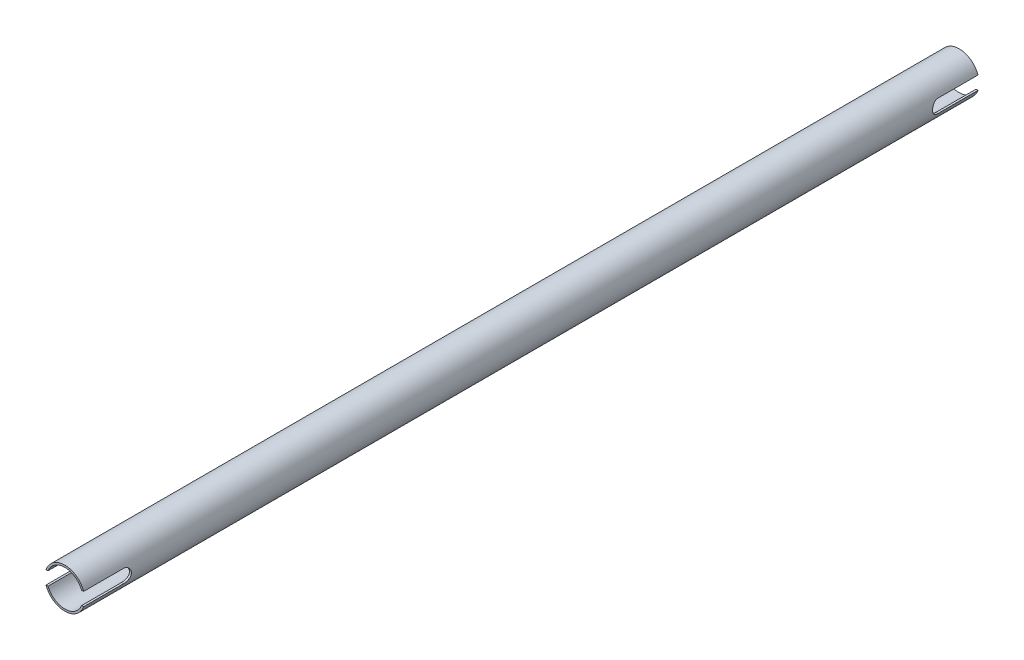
ISO-10303-21;
HEADER;
FILE_DESCRIPTION(('STEP AP214'),'2;1');
FILE_NAME('part.step','',(''),(''),'','','');
FILE_SCHEMA(('AUTOMOTIVE_DESIGN { 1 0 10303 214 1 1 1 1 }'));
ENDSEC;
DATA;
#1=APPLICATION_CONTEXT('core data for automotive mechanical design processes');
#2=APPLICATION_PROTOCOL_DEFINITION('international standard','automotive_design',2000,#1);
#3=PRODUCT_CONTEXT('',#1,'mechanical');
#4=PRODUCT('Part','Part','',(#3));
#5=PRODUCT_RELATED_PRODUCT_CATEGORY('part','',(#4));
#6=PRODUCT_DEFINITION_FORMATION('','',#4);
#7=PRODUCT_DEFINITION_CONTEXT('part definition',#1,'design');
#8=PRODUCT_DEFINITION('design','',#6,#7);
#9=PRODUCT_DEFINITION_SHAPE('','',#8);
#10=(LENGTH_UNIT() NAMED_UNIT(*) SI_UNIT(.MILLI.,.METRE.));
#11=(NAMED_UNIT(*) PLANE_ANGLE_UNIT() SI_UNIT($,.RADIAN.));
#12=(NAMED_UNIT(*) SI_UNIT($,.STERADIAN.) SOLID_ANGLE_UNIT());
#13=UNCERTAINTY_MEASURE_WITH_UNIT(LENGTH_MEASURE(1.E-05),#10,'distance_accuracy_value','');
#14=(GEOMETRIC_REPRESENTATION_CONTEXT(3) GLOBAL_UNCERTAINTY_ASSIGNED_CONTEXT((#13)) GLOBAL_UNIT_ASSIGNED_CONTEXT((#10,
#11,#12)) REPRESENTATION_CONTEXT('',''));
#15=CARTESIAN_POINT('',(0.,0.,0.));
#16=DIRECTION('',(0.,0.,1.));
#17=DIRECTION('',(1.,0.,0.));
#18=AXIS2_PLACEMENT_3D('',#15,#16,#17);
#19=CARTESIAN_POINT('',(0.,0.,0.));
#20=DIRECTION('',(0.,0.,1.));
#21=DIRECTION('',(1.,0.,0.));
#22=AXIS2_PLACEMENT_3D('',#19,#20,#21);
#23=PLANE('',#22);
#24=CARTESIAN_POINT('',(0.,0.,0.));
#25=DIRECTION('',(0.,0.,1.));
#26=DIRECTION('',(1.,0.,0.));
#27=AXIS2_PLACEMENT_3D('',#24,#25,#26);
#28=CIRCLE('',#27,9.525);
#29=CARTESIAN_POINT('',(8.98025612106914,3.17500000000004,0.));
#30=VERTEX_POINT('',#29);
#31=CARTESIAN_POINT('',(-8.98025612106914,3.17500000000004,0.));
#32=VERTEX_POINT('',#31);
#33=EDGE_CURVE('E176',#30,#32,#28,.T.);
#34=ORIENTED_EDGE('',*,*,#33,.F.);
#35=DIRECTION('',(1.,0.,0.));
#36=VECTOR('',#35,1.);
#37=CARTESIAN_POINT('',(-9.525,3.17500000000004,0.));
#38=LINE('',#37,#36);
#39=CARTESIAN_POINT('',(8.00659451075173,3.17500000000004,0.));
#40=VERTEX_POINT('',#39);
#41=EDGE_CURVE('E164',#40,#30,#38,.T.);
#42=ORIENTED_EDGE('',*,*,#41,.F.);
#43=CARTESIAN_POINT('',(0.,0.,0.));
#44=DIRECTION('',(0.,0.,1.));
#45=DIRECTION('',(1.,0.,0.));
#46=AXIS2_PLACEMENT_3D('',#43,#44,#45);
#47=CIRCLE('',#46,8.61314);
#48=CARTESIAN_POINT('',(-8.00659451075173,3.17500000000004,0.));
#49=VERTEX_POINT('',#48);
#50=EDGE_CURVE('E240',#40,#49,#47,.T.);
#51=ORIENTED_EDGE('',*,*,#50,.T.);
#52=EDGE_CURVE('E450',#32,#49,#38,.T.);
#53=ORIENTED_EDGE('',*,*,#52,.F.);
#54=EDGE_LOOP('',(#34,#42,#51,#53));
#55=FACE_BOUND('',#54,.T.);
#56=ADVANCED_FACE('F42',(#55),#23,.F.);
#57=CARTESIAN_POINT('',(0.,0.,426.588936));
#58=DIRECTION('',(0.,0.,1.));
#59=DIRECTION('',(1.,0.,0.));
#60=AXIS2_PLACEMENT_3D('',#57,#58,#59);
#61=PLANE('',#60);
#62=DIRECTION('',(1.,0.,0.));
#63=VECTOR('',#62,1.);
#64=CARTESIAN_POINT('',(-9.525,3.175,426.588936));
#65=LINE('',#64,#63);
#66=CARTESIAN_POINT('',(8.00659451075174,3.175,426.588936));
#67=VERTEX_POINT('',#66);
#68=CARTESIAN_POINT('',(8.98025612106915,3.175,426.588936));
#69=VERTEX_POINT('',#68);
#70=EDGE_CURVE('E290',#67,#69,#65,.T.);
#71=ORIENTED_EDGE('',*,*,#70,.T.);
#72=CARTESIAN_POINT('',(0.,0.,426.588936));
#73=DIRECTION('',(0.,0.,1.));
#74=DIRECTION('',(1.,0.,0.));
#75=AXIS2_PLACEMENT_3D('',#72,#73,#74);
#76=CIRCLE('',#75,9.525);
#77=CARTESIAN_POINT('',(-8.98025612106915,3.175,426.588936));
#78=VERTEX_POINT('',#77);
#79=EDGE_CURVE('E188',#69,#78,#76,.T.);
#80=ORIENTED_EDGE('',*,*,#79,.T.);
#81=CARTESIAN_POINT('',(-8.00659451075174,3.175,426.588936));
#82=VERTEX_POINT('',#81);
#83=EDGE_CURVE('E293',#78,#82,#65,.T.);
#84=ORIENTED_EDGE('',*,*,#83,.T.);
#85=CARTESIAN_POINT('',(0.,0.,426.588936));
#86=DIRECTION('',(0.,0.,1.));
#87=DIRECTION('',(1.,0.,0.));
#88=AXIS2_PLACEMENT_3D('',#85,#86,#87);
#89=CIRCLE('',#88,8.61314);
#90=EDGE_CURVE('E177',#67,#82,#89,.T.);
#91=ORIENTED_EDGE('',*,*,#90,.F.);
#92=EDGE_LOOP('',(#71,#80,#84,#91));
#93=FACE_BOUND('',#92,.T.);
#94=ADVANCED_FACE('F313',(#93),#61,.T.);
#95=DIRECTION('',(1.,0.,0.));
#96=VECTOR('',#95,1.);
#97=CARTESIAN_POINT('',(-9.525,-3.175,426.588936));
#98=LINE('',#97,#96);
#99=CARTESIAN_POINT('',(-8.98025612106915,-3.175,426.588936));
#100=VERTEX_POINT('',#99);
#101=CARTESIAN_POINT('',(-8.00659451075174,-3.175,426.588936));
#102=VERTEX_POINT('',#101);
#103=EDGE_CURVE('E302',#100,#102,#98,.T.);
#104=ORIENTED_EDGE('',*,*,#103,.F.);
#105=CARTESIAN_POINT('',(8.98025612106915,-3.175,426.588936));
#106=VERTEX_POINT('',#105);
#107=EDGE_CURVE('E180',#100,#106,#76,.T.);
#108=ORIENTED_EDGE('',*,*,#107,.T.);
#109=CARTESIAN_POINT('',(8.00659451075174,-3.175,426.588936));
#110=VERTEX_POINT('',#109);
#111=EDGE_CURVE('E289',#110,#106,#98,.T.);
#112=ORIENTED_EDGE('',*,*,#111,.F.);
#113=EDGE_CURVE('E182',#102,#110,#89,.T.);
#114=ORIENTED_EDGE('',*,*,#113,.F.);
#115=EDGE_LOOP('',(#104,#108,#112,#114));
#116=FACE_BOUND('',#115,.T.);
#117=ADVANCED_FACE('F334',(#116),#61,.T.);
#118=CARTESIAN_POINT('',(-8.98025612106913,-3.17499999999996,0.));
#119=VERTEX_POINT('',#118);
#120=CARTESIAN_POINT('',(8.98025612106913,-3.17499999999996,0.));
#121=VERTEX_POINT('',#120);
#122=EDGE_CURVE('E169',#119,#121,#28,.T.);
#123=ORIENTED_EDGE('',*,*,#122,.F.);
#124=DIRECTION('',(1.,0.,0.));
#125=VECTOR('',#124,1.);
#126=CARTESIAN_POINT('',(-9.525,-3.17499999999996,0.));
#127=LINE('',#126,#125);
#128=CARTESIAN_POINT('',(-8.00659451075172,-3.17499999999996,0.));
#129=VERTEX_POINT('',#128);
#130=EDGE_CURVE('E154',#119,#129,#127,.T.);
#131=ORIENTED_EDGE('',*,*,#130,.T.);
#132=CARTESIAN_POINT('',(8.00659451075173,-3.17500000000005,0.));
#133=VERTEX_POINT('',#132);
#134=EDGE_CURVE('E239',#129,#133,#47,.T.);
#135=ORIENTED_EDGE('',*,*,#134,.T.);
#136=EDGE_CURVE('E66',#133,#121,#127,.T.);
#137=ORIENTED_EDGE('',*,*,#136,.T.);
#138=EDGE_LOOP('',(#123,#131,#135,#137));
#139=FACE_BOUND('',#138,.T.);
#140=ADVANCED_FACE('F175',(#139),#23,.F.);
#141=CARTESIAN_POINT('',(0.,0.,426.588936));
#142=DIRECTION('',(0.,0.,-1.));
#143=DIRECTION('',(-1.,0.,0.));
#144=AXIS2_PLACEMENT_3D('',#141,#142,#143);
#145=CYLINDRICAL_SURFACE('',#144,9.525);
#146=DIRECTION('',(0.,0.,-1.));
#147=VECTOR('',#146,1.);
#148=CARTESIAN_POINT('',(-8.98025612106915,-3.175,426.588936));
#149=LINE('',#148,#147);
#150=CARTESIAN_POINT('',(-8.98025612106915,-3.175,407.538936));
#151=VERTEX_POINT('',#150);
#152=EDGE_CURVE('E229',#100,#151,#149,.T.);
#153=ORIENTED_EDGE('',*,*,#152,.T.);
#154=CARTESIAN_POINT('',(-9.525,0.,410.713936));
#155=CARTESIAN_POINT('',(-9.52500048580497,-0.173238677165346,410.713936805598));
#156=CARTESIAN_POINT('',(-9.52023018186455,-0.346472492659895,410.699711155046));
#157=CARTESIAN_POINT('',(-9.50167042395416,-0.687837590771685,410.643358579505));
#158=CARTESIAN_POINT('',(-9.48788003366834,-0.855968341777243,410.601228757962));
#159=CARTESIAN_POINT('',(-9.45277852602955,-1.18215660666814,410.490672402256));
#160=CARTESIAN_POINT('',(-9.43147998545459,-1.34023044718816,410.422289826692));
#161=CARTESIAN_POINT('',(-9.3835361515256,-1.6426654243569,410.261367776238));
#162=CARTESIAN_POINT('',(-9.35688980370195,-1.78702384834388,410.168823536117));
#163=CARTESIAN_POINT('',(-9.30002249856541,-2.06292981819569,409.958839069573));
#164=CARTESIAN_POINT('',(-9.26971591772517,-2.19393674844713,409.840711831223));
#165=CARTESIAN_POINT('',(-9.20941499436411,-2.43469379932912,409.584375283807));
#166=CARTESIAN_POINT('',(-9.17942072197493,-2.54443923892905,409.446161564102));
#167=CARTESIAN_POINT('',(-9.12219830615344,-2.74264419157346,409.148708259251));
#168=CARTESIAN_POINT('',(-9.0950744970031,-2.83040092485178,408.988978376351));
#169=CARTESIAN_POINT('',(-9.04796594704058,-2.97757492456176,408.655976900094));
#170=CARTESIAN_POINT('',(-9.02797902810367,-3.03700083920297,408.482709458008));
#171=CARTESIAN_POINT('',(-8.99830887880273,-3.12379824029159,408.133698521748));
#172=CARTESIAN_POINT('',(-8.98830104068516,-3.15218269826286,407.958235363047));
#173=CARTESIAN_POINT('',(-8.97876209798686,-3.17925806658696,407.604773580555));
#174=CARTESIAN_POINT('',(-8.97922775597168,-3.17795815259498,407.426775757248));
#175=CARTESIAN_POINT('',(-8.99029872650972,-3.14648819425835,407.08193719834));
#176=CARTESIAN_POINT('',(-9.00043970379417,-3.1176401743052,406.914958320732));
#177=CARTESIAN_POINT('',(-9.02895888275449,-3.03404956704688,406.588361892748));
#178=CARTESIAN_POINT('',(-9.04733807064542,-2.97930387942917,406.428745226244));
#179=CARTESIAN_POINT('',(-9.09059367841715,-2.84460650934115,406.118400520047));
#180=CARTESIAN_POINT('',(-9.11556996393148,-2.76426310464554,405.967857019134));
#181=CARTESIAN_POINT('',(-9.16916373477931,-2.58092291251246,405.681970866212));
#182=CARTESIAN_POINT('',(-9.19778227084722,-2.47791958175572,405.546632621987));
#183=CARTESIAN_POINT('',(-9.25726270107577,-2.24583413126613,405.28757017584));
#184=CARTESIAN_POINT('',(-9.28816371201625,-2.11567125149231,405.164821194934));
#185=CARTESIAN_POINT('',(-9.34742029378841,-1.83622813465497,404.942639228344));
#186=CARTESIAN_POINT('',(-9.37577562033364,-1.68694606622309,404.843208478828));
#187=CARTESIAN_POINT('',(-9.42711817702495,-1.37143367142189,404.669700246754));
#188=CARTESIAN_POINT('',(-9.45004936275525,-1.20504990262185,404.595884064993));
#189=CARTESIAN_POINT('',(-9.48755300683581,-0.861279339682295,404.477590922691));
#190=CARTESIAN_POINT('',(-9.50212836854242,-0.683896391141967,404.433103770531));
#191=CARTESIAN_POINT('',(-9.52079715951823,-0.331418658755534,404.376459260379));
#192=CARTESIAN_POINT('',(-9.52531755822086,-0.15655797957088,404.362984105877));
#193=CARTESIAN_POINT('',(-9.52464766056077,0.192960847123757,404.364992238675));
#194=CARTESIAN_POINT('',(-9.51945900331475,0.367619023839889,404.380470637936));
#195=CARTESIAN_POINT('',(-9.50023578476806,0.706500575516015,404.438903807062));
#196=CARTESIAN_POINT('',(-9.48646180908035,0.870879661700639,404.481049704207));
#197=CARTESIAN_POINT('',(-9.45171613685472,1.19016766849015,404.590610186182));
#198=CARTESIAN_POINT('',(-9.43074352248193,1.34507537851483,404.65802799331));
#199=CARTESIAN_POINT('',(-9.38304356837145,1.64556534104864,404.818184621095));
#200=CARTESIAN_POINT('',(-9.35617936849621,1.79079512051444,404.911542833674));
#201=CARTESIAN_POINT('',(-9.29974181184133,2.0639558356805,405.120202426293));
#202=CARTESIAN_POINT('',(-9.27016762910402,2.19188146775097,405.235510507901));
#203=CARTESIAN_POINT('',(-9.20993992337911,2.43285171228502,405.490993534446));
#204=CARTESIAN_POINT('',(-9.17929841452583,2.54495607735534,405.632060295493));
#205=CARTESIAN_POINT('',(-9.121774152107,2.74401763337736,405.9316607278));
#206=CARTESIAN_POINT('',(-9.09489142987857,2.83097461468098,406.090194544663));
#207=CARTESIAN_POINT('',(-9.04819093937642,2.97687025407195,406.420297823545));
#208=CARTESIAN_POINT('',(-9.02835890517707,3.03586556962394,406.591840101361));
#209=CARTESIAN_POINT('',(-8.99829392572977,3.12386556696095,406.94323821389));
#210=CARTESIAN_POINT('',(-8.98805665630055,3.15288375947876,407.123090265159));
#211=CARTESIAN_POINT('',(-8.97883201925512,3.17905219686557,407.47606177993));
#212=CARTESIAN_POINT('',(-8.97929370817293,3.17776306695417,407.649052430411));
#213=CARTESIAN_POINT('',(-8.99005281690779,3.1471942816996,407.992215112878));
#214=CARTESIAN_POINT('',(-9.00034965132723,3.11791629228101,408.162387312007));
#215=CARTESIAN_POINT('',(-9.02920864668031,3.03330550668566,408.491866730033));
#216=CARTESIAN_POINT('',(-9.04761011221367,2.97847812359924,408.651318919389));
#217=CARTESIAN_POINT('',(-9.09054566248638,2.84473448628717,408.958883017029));
#218=CARTESIAN_POINT('',(-9.11508110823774,2.76581288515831,409.106992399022));
#219=CARTESIAN_POINT('',(-9.16885482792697,2.58210269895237,409.394671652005));
#220=CARTESIAN_POINT('',(-9.19825159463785,2.47633567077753,409.533586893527));
#221=CARTESIAN_POINT('',(-9.25777156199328,2.24359115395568,409.792201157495));
#222=CARTESIAN_POINT('',(-9.28789496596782,2.11660766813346,409.91189472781));
#223=CARTESIAN_POINT('',(-9.34688346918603,1.83909194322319,410.133369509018));
#224=CARTESIAN_POINT('',(-9.3756537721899,1.68783480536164,410.234270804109));
#225=CARTESIAN_POINT('',(-9.42740021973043,1.36955960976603,410.409105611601));
#226=CARTESIAN_POINT('',(-9.45037784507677,1.20254559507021,410.483046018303));
#227=CARTESIAN_POINT('',(-9.4870751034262,0.865167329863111,410.598752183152));
#228=CARTESIAN_POINT('',(-9.50116249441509,0.695286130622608,410.641807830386));
#229=CARTESIAN_POINT('',(-9.52012342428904,0.35026732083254,410.69939539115));
#230=CARTESIAN_POINT('',(-9.52499950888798,0.175131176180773,410.713935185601));
#231=CARTESIAN_POINT('',(-9.525,0.,410.713936));
#232=B_SPLINE_CURVE_WITH_KNOTS('',3,(#154,#155,#156,#157,#158,#159,#160,#161,#162,#163,#164,
#165,#166,#167,#168,#169,#170,#171,#172,#173,#174,#175,#176,#177,#178,#179,#180,#181,#182,#183,
#184,#185,#186,#187,#188,#189,#190,#191,#192,#193,#194,#195,#196,#197,#198,#199,#200,#201,#202,
#203,#204,#205,#206,#207,#208,#209,#210,#211,#212,#213,#214,#215,#216,#217,#218,#219,#220,#221,
#222,#223,#224,#225,#226,#227,#228,#229,#230,#231),.UNSPECIFIED.,.T.,.F.,(4,2,2,2,2,2,2,2,2,2,2,
2,2,2,2,2,2,2,2,2,2,2,2,2,2,2,2,2,2,2,2,2,2,2,2,2,2,2,4),(0.,0.519071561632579,1.03819701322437,
1.55645698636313,2.07481924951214,2.6093637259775,3.14402575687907,3.69406121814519,
4.24392866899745,4.77526114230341,5.30642937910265,5.81332424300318,6.32027980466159,
6.83539943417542,7.35066800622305,7.89283745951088,8.43505888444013,8.98265937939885,
9.53006948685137,10.0537512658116,10.5773446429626,11.0857715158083,11.5942632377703,
12.1161301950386,12.6381567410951,13.1839024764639,13.7296527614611,14.2742924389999,
14.8186865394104,15.3351123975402,15.8515075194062,16.3580948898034,16.8647947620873,
17.3936046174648,17.92256420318,18.4721392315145,19.0215736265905,19.5464607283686,
20.0712027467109),.UNSPECIFIED.);
#233=CARTESIAN_POINT('',(-8.98025612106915,3.175,407.538936));
#234=VERTEX_POINT('',#233);
#235=EDGE_CURVE('E228',#151,#234,#232,.T.);
#236=ORIENTED_EDGE('',*,*,#235,.T.);
#237=DIRECTION('',(0.,0.,-1.));
#238=VECTOR('',#237,1.);
#239=CARTESIAN_POINT('',(-8.98025612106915,3.175,426.588936));
#240=LINE('',#239,#238);
#241=EDGE_CURVE('E234',#234,#78,#240,.F.);
#242=ORIENTED_EDGE('',*,*,#241,.T.);
#243=ORIENTED_EDGE('',*,*,#79,.F.);
#244=DIRECTION('',(0.,0.,-1.));
#245=VECTOR('',#244,1.);
#246=CARTESIAN_POINT('',(8.98025612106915,3.175,426.588936));
#247=LINE('',#246,#245);
#248=CARTESIAN_POINT('',(8.98025612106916,3.175,407.538936));
#249=VERTEX_POINT('',#248);
#250=EDGE_CURVE('E237',#69,#249,#247,.T.);
#251=ORIENTED_EDGE('',*,*,#250,.T.);
#252=CARTESIAN_POINT('',(9.525,0.,404.363936));
#253=CARTESIAN_POINT('',(9.52500048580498,-0.173238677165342,404.363935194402));
#254=CARTESIAN_POINT('',(9.52023018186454,-0.346472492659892,404.378160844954));
#255=CARTESIAN_POINT('',(9.50167042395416,-0.687837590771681,404.434513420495));
#256=CARTESIAN_POINT('',(9.48788003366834,-0.855968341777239,404.476643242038));
#257=CARTESIAN_POINT('',(9.45277852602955,-1.18215660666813,404.587199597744));
#258=CARTESIAN_POINT('',(9.43147998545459,-1.34023044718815,404.655582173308));
#259=CARTESIAN_POINT('',(9.3835361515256,-1.6426654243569,404.816504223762));
#260=CARTESIAN_POINT('',(9.35688980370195,-1.78702384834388,404.909048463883));
#261=CARTESIAN_POINT('',(9.30002249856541,-2.06292981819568,405.119032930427));
#262=CARTESIAN_POINT('',(9.26971591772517,-2.19393674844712,405.237160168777));
#263=CARTESIAN_POINT('',(9.2094149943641,-2.43469379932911,405.493496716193));
#264=CARTESIAN_POINT('',(9.17942072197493,-2.54443923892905,405.631710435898));
#265=CARTESIAN_POINT('',(9.12219830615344,-2.74264419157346,405.929163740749));
#266=CARTESIAN_POINT('',(9.0950744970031,-2.83040092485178,406.08889362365));
#267=CARTESIAN_POINT('',(9.04796594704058,-2.97757492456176,406.421895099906));
#268=CARTESIAN_POINT('',(9.02797902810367,-3.03700083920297,406.595162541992));
#269=CARTESIAN_POINT('',(8.99830887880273,-3.12379824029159,406.944173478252));
#270=CARTESIAN_POINT('',(8.98830104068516,-3.15218269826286,407.119636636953));
#271=CARTESIAN_POINT('',(8.97876209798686,-3.17925806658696,407.473098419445));
#272=CARTESIAN_POINT('',(8.97922775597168,-3.17795815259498,407.651096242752));
#273=CARTESIAN_POINT('',(8.99029872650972,-3.14648819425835,407.99593480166));
#274=CARTESIAN_POINT('',(9.00043970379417,-3.1176401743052,408.162913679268));
#275=CARTESIAN_POINT('',(9.02895888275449,-3.03404956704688,408.489510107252));
#276=CARTESIAN_POINT('',(9.04733807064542,-2.97930387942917,408.649126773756));
#277=CARTESIAN_POINT('',(9.09059367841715,-2.84460650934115,408.959471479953));
#278=CARTESIAN_POINT('',(9.11556996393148,-2.76426310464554,409.110014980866));
#279=CARTESIAN_POINT('',(9.16916373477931,-2.58092291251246,409.395901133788));
#280=CARTESIAN_POINT('',(9.19778227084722,-2.47791958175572,409.531239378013));
#281=CARTESIAN_POINT('',(9.25726270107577,-2.24583413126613,409.790301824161));
#282=CARTESIAN_POINT('',(9.28816371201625,-2.11567125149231,409.913050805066));
#283=CARTESIAN_POINT('',(9.34742029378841,-1.83622813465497,410.135232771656));
#284=CARTESIAN_POINT('',(9.37577562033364,-1.68694606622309,410.234663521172));
#285=CARTESIAN_POINT('',(9.42711817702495,-1.37143367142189,410.408171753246));
#286=CARTESIAN_POINT('',(9.45004936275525,-1.20504990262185,410.481987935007));
#287=CARTESIAN_POINT('',(9.4875530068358,-0.861279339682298,410.600281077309));
#288=CARTESIAN_POINT('',(9.50212836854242,-0.68389639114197,410.644768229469));
#289=CARTESIAN_POINT('',(9.52079715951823,-0.331418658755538,410.701412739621));
#290=CARTESIAN_POINT('',(9.52531755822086,-0.156557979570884,410.714887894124));
#291=CARTESIAN_POINT('',(9.52464766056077,0.192960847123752,410.712879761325));
#292=CARTESIAN_POINT('',(9.51945900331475,0.367619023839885,410.697401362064));
#293=CARTESIAN_POINT('',(9.50023578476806,0.706500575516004,410.638968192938));
#294=CARTESIAN_POINT('',(9.48646180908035,0.870879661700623,410.596822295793));
#295=CARTESIAN_POINT('',(9.45171613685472,1.19016766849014,410.487261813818));
#296=CARTESIAN_POINT('',(9.43074352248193,1.34507537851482,410.41984400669));
#297=CARTESIAN_POINT('',(9.38304356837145,1.64556534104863,410.259687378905));
#298=CARTESIAN_POINT('',(9.35617936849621,1.79079512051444,410.166329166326));
#299=CARTESIAN_POINT('',(9.29974181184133,2.06395583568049,409.957669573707));
#300=CARTESIAN_POINT('',(9.27016762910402,2.19188146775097,409.842361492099));
#301=CARTESIAN_POINT('',(9.20993992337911,2.43285171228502,409.586878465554));
#302=CARTESIAN_POINT('',(9.17929841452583,2.54495607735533,409.445811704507));
#303=CARTESIAN_POINT('',(9.12177415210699,2.74401763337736,409.1462112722));
#304=CARTESIAN_POINT('',(9.09489142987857,2.83097461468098,408.987677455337));
#305=CARTESIAN_POINT('',(9.04819093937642,2.97687025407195,408.657574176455));
#306=CARTESIAN_POINT('',(9.02835890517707,3.03586556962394,408.486031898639));
#307=CARTESIAN_POINT('',(8.99829392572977,3.12386556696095,408.13463378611));
#308=CARTESIAN_POINT('',(8.98805665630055,3.15288375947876,407.954781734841));
#309=CARTESIAN_POINT('',(8.97883201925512,3.17905219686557,407.60181022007));
#310=CARTESIAN_POINT('',(8.97929370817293,3.17776306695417,407.428819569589));
#311=CARTESIAN_POINT('',(8.99005281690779,3.1471942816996,407.085656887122));
#312=CARTESIAN_POINT('',(9.00034965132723,3.11791629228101,406.915484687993));
#313=CARTESIAN_POINT('',(9.02920864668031,3.03330550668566,406.586005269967));
#314=CARTESIAN_POINT('',(9.04761011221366,2.97847812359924,406.426553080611));
#315=CARTESIAN_POINT('',(9.09054566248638,2.84473448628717,406.118988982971));
#316=CARTESIAN_POINT('',(9.11508110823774,2.76581288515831,405.970879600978));
#317=CARTESIAN_POINT('',(9.16885482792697,2.58210269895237,405.683200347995));
#318=CARTESIAN_POINT('',(9.19825159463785,2.47633567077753,405.544285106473));
#319=CARTESIAN_POINT('',(9.25777156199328,2.24359115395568,405.285670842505));
#320=CARTESIAN_POINT('',(9.28789496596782,2.11660766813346,405.16597727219));
#321=CARTESIAN_POINT('',(9.34688346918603,1.83909194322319,404.944502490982));
#322=CARTESIAN_POINT('',(9.3756537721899,1.68783480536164,404.843601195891));
#323=CARTESIAN_POINT('',(9.42740021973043,1.36955960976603,404.668766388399));
#324=CARTESIAN_POINT('',(9.45037784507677,1.20254559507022,404.594825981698));
#325=CARTESIAN_POINT('',(9.4870751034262,0.865167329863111,404.479119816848));
#326=CARTESIAN_POINT('',(9.50116249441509,0.695286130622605,404.436064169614));
#327=CARTESIAN_POINT('',(9.52012342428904,0.350267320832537,404.37847660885));
#328=CARTESIAN_POINT('',(9.52499950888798,0.175131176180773,404.363936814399));
#329=CARTESIAN_POINT('',(9.525,0.,404.363936));
#330=B_SPLINE_CURVE_WITH_KNOTS('',3,(#252,#253,#254,#255,#256,#257,#258,#259,#260,#261,#262,
#263,#264,#265,#266,#267,#268,#269,#270,#271,#272,#273,#274,#275,#276,#277,#278,#279,#280,#281,
#282,#283,#284,#285,#286,#287,#288,#289,#290,#291,#292,#293,#294,#295,#296,#297,#298,#299,#300,
#301,#302,#303,#304,#305,#306,#307,#308,#309,#310,#311,#312,#313,#314,#315,#316,#317,#318,#319,
#320,#321,#322,#323,#324,#325,#326,#327,#328,#329),.UNSPECIFIED.,.T.,.F.,(4,2,2,2,2,2,2,2,2,2,2,
2,2,2,2,2,2,2,2,2,2,2,2,2,2,2,2,2,2,2,2,2,2,2,2,2,2,2,4),(0.,0.51907156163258,1.03819701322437,
1.55645698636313,2.07481924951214,2.6093637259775,3.14402575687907,3.69406121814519,
4.24392866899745,4.77526114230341,5.30642937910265,5.81332424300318,6.32027980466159,
6.83539943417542,7.35066800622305,7.89283745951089,8.43505888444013,8.98265937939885,
9.53006948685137,10.0537512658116,10.5773446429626,11.0857715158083,11.5942632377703,
12.1161301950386,12.638156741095,13.1839024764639,13.7296527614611,14.2742924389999,
14.8186865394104,15.3351123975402,15.8515075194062,16.3580948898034,16.8647947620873,
17.3936046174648,17.92256420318,18.4721392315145,19.0215736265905,19.5464607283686,
20.071202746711),.UNSPECIFIED.);
#331=CARTESIAN_POINT('',(8.98025612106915,-3.175,407.538936));
#332=VERTEX_POINT('',#331);
#333=EDGE_CURVE('E224',#249,#332,#330,.T.);
#334=ORIENTED_EDGE('',*,*,#333,.T.);
#335=DIRECTION('',(0.,0.,-1.));
#336=VECTOR('',#335,1.);
#337=CARTESIAN_POINT('',(8.98025612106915,-3.175,426.588936));
#338=LINE('',#337,#336);
#339=EDGE_CURVE('E303',#332,#106,#338,.F.);
#340=ORIENTED_EDGE('',*,*,#339,.T.);
#341=ORIENTED_EDGE('',*,*,#107,.F.);
#342=EDGE_LOOP('',(#153,#236,#242,#243,#251,#334,#340,#341));
#343=FACE_BOUND('',#342,.T.);
#344=CARTESIAN_POINT('',(-9.525,0.,22.2249999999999));
#345=CARTESIAN_POINT('',(-9.52500048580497,-0.173238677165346,22.2250008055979));
#346=CARTESIAN_POINT('',(-9.52023018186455,-0.346472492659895,22.210775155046));
#347=CARTESIAN_POINT('',(-9.50167042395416,-0.687837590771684,22.1544225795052));
#348=CARTESIAN_POINT('',(-9.48788003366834,-0.855968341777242,22.112292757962));
#349=CARTESIAN_POINT('',(-9.45277852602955,-1.18215660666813,22.0017364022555));
#350=CARTESIAN_POINT('',(-9.43147998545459,-1.34023044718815,21.9333538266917));
#351=CARTESIAN_POINT('',(-9.3835361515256,-1.64266542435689,21.7724317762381));
#352=CARTESIAN_POINT('',(-9.35688980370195,-1.78702384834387,21.6798875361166));
#353=CARTESIAN_POINT('',(-9.30002249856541,-2.06292981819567,21.4699030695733));
#354=CARTESIAN_POINT('',(-9.26971591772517,-2.1939367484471,21.3517758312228));
#355=CARTESIAN_POINT('',(-9.20941499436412,-2.43469379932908,21.0954392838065));
#356=CARTESIAN_POINT('',(-9.17942072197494,-2.544439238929,20.9572255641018));
#357=CARTESIAN_POINT('',(-9.12219830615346,-2.7426441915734,20.659772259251));
#358=CARTESIAN_POINT('',(-9.09507449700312,-2.83040092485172,20.5000423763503));
#359=CARTESIAN_POINT('',(-9.04796594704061,-2.97757492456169,20.1670409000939));
#360=CARTESIAN_POINT('',(-9.0279790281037,-3.0370008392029,19.9937734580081));
#361=CARTESIAN_POINT('',(-8.99830887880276,-3.1237982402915,19.6447625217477));
#362=CARTESIAN_POINT('',(-8.98830104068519,-3.15218269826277,19.469299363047));
#363=CARTESIAN_POINT('',(-8.9787620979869,-3.17925806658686,19.1158375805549));
#364=CARTESIAN_POINT('',(-8.97922775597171,-3.17795815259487,18.9378397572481));
#365=CARTESIAN_POINT('',(-8.99029872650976,-3.14648819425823,18.59300119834));
#366=CARTESIAN_POINT('',(-9.00043970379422,-3.11764017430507,18.4260223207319));
#367=CARTESIAN_POINT('',(-9.02895888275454,-3.03404956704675,18.0994258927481));
#368=CARTESIAN_POINT('',(-9.04733807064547,-2.97930387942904,17.9398092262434));
#369=CARTESIAN_POINT('',(-9.0905936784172,-2.84460650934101,17.6294645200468));
#370=CARTESIAN_POINT('',(-9.11556996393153,-2.76426310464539,17.4789210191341));
#371=CARTESIAN_POINT('',(-9.16916373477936,-2.58092291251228,17.1930348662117));
#372=CARTESIAN_POINT('',(-9.19778227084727,-2.47791958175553,17.0576966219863));
#373=CARTESIAN_POINT('',(-9.25726270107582,-2.24583413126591,16.7986341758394));
#374=CARTESIAN_POINT('',(-9.28816371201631,-2.11567125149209,16.6758851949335));
#375=CARTESIAN_POINT('',(-9.34742029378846,-1.83622813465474,16.4537032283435));
#376=CARTESIAN_POINT('',(-9.37577562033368,-1.68694606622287,16.3542724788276));
#377=CARTESIAN_POINT('',(-9.42711817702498,-1.37143367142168,16.1807642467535));
#378=CARTESIAN_POINT('',(-9.45004936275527,-1.20504990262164,16.106948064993));
#379=CARTESIAN_POINT('',(-9.48755300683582,-0.861279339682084,15.9886549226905));
#380=CARTESIAN_POINT('',(-9.50212836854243,-0.68389639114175,15.9441677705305));
#381=CARTESIAN_POINT('',(-9.52079715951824,-0.331418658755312,15.8875232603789));
#382=CARTESIAN_POINT('',(-9.52531755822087,-0.15655797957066,15.8740481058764));
#383=CARTESIAN_POINT('',(-9.52464766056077,0.192960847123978,15.876056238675));
#384=CARTESIAN_POINT('',(-9.51945900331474,0.367619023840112,15.891534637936));
#385=CARTESIAN_POINT('',(-9.50023578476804,0.706500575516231,15.9499678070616));
#386=CARTESIAN_POINT('',(-9.48646180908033,0.870879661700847,15.9921137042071));
#387=CARTESIAN_POINT('',(-9.45171613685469,1.19016766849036,16.1016741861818));
#388=CARTESIAN_POINT('',(-9.4307435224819,1.34507537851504,16.1690919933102));
#389=CARTESIAN_POINT('',(-9.38304356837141,1.64556534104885,16.3292486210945));
#390=CARTESIAN_POINT('',(-9.35617936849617,1.79079512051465,16.422606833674));
#391=CARTESIAN_POINT('',(-9.29974181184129,2.06395583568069,16.6312664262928));
#392=CARTESIAN_POINT('',(-9.27016762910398,2.19188146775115,16.7465745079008));
#393=CARTESIAN_POINT('',(-9.20993992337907,2.43285171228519,17.0020575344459));
#394=CARTESIAN_POINT('',(-9.17929841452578,2.54495607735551,17.1431242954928));
#395=CARTESIAN_POINT('',(-9.12177415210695,2.74401763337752,17.4427247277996));
#396=CARTESIAN_POINT('',(-9.09489142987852,2.83097461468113,17.6012585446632));
#397=CARTESIAN_POINT('',(-9.04819093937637,2.9768702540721,17.9313618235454));
#398=CARTESIAN_POINT('',(-9.02835890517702,3.03586556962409,18.1029041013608));
#399=CARTESIAN_POINT('',(-8.99829392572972,3.12386556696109,18.4543022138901));
#400=CARTESIAN_POINT('',(-8.9880566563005,3.15288375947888,18.6341542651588));
#401=CARTESIAN_POINT('',(-8.97883201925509,3.17905219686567,18.9871257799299));
#402=CARTESIAN_POINT('',(-8.97929370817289,3.17776306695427,19.1601164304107));
#403=CARTESIAN_POINT('',(-8.99005281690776,3.14719428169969,19.5032791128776));
#404=CARTESIAN_POINT('',(-9.0003496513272,3.1179162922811,19.6734513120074));
#405=CARTESIAN_POINT('',(-9.02920864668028,3.03330550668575,20.0029307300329));
#406=CARTESIAN_POINT('',(-9.04761011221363,2.97847812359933,20.1623829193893));
#407=CARTESIAN_POINT('',(-9.09054566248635,2.84473448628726,20.469947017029));
#408=CARTESIAN_POINT('',(-9.11508110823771,2.76581288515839,20.6180563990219));
#409=CARTESIAN_POINT('',(-9.16885482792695,2.58210269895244,20.9057356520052));
#410=CARTESIAN_POINT('',(-9.19825159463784,2.47633567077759,21.0446508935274));
#411=CARTESIAN_POINT('',(-9.25777156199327,2.24359115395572,21.3032651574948));
#412=CARTESIAN_POINT('',(-9.28789496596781,2.11660766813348,21.4229587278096));
#413=CARTESIAN_POINT('',(-9.34688346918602,1.8390919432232,21.6444335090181));
#414=CARTESIAN_POINT('',(-9.37565377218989,1.68783480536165,21.7453348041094));
#415=CARTESIAN_POINT('',(-9.42740021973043,1.36955960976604,21.9201696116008));
#416=CARTESIAN_POINT('',(-9.45037784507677,1.20254559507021,21.9941100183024));
#417=CARTESIAN_POINT('',(-9.4870751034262,0.865167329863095,22.1098161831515));
#418=CARTESIAN_POINT('',(-9.50116249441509,0.695286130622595,22.1528718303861));
#419=CARTESIAN_POINT('',(-9.52012342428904,0.350267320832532,22.2104593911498));
#420=CARTESIAN_POINT('',(-9.52499950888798,0.175131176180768,22.2249991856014));
#421=CARTESIAN_POINT('',(-9.525,0.,22.2249999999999));
#422=B_SPLINE_CURVE_WITH_KNOTS('',3,(#344,#345,#346,#347,#348,#349,#350,#351,#352,#353,#354,
#355,#356,#357,#358,#359,#360,#361,#362,#363,#364,#365,#366,#367,#368,#369,#370,#371,#372,#373,
#374,#375,#376,#377,#378,#379,#380,#381,#382,#383,#384,#385,#386,#387,#388,#389,#390,#391,#392,
#393,#394,#395,#396,#397,#398,#399,#400,#401,#402,#403,#404,#405,#406,#407,#408,#409,#410,#411,
#412,#413,#414,#415,#416,#417,#418,#419,#420,#421),.UNSPECIFIED.,.T.,.F.,(4,2,2,2,2,2,2,2,2,2,2,
2,2,2,2,2,2,2,2,2,2,2,2,2,2,2,2,2,2,2,2,2,2,2,2,2,2,2,4),(0.,0.519071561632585,1.03819701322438,
1.55645698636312,2.07481924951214,2.6093637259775,3.14402575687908,3.69406121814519,
4.24392866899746,4.77526114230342,5.30642937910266,5.81332424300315,6.32027980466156,
6.8353994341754,7.35066800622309,7.89283745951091,8.43505888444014,8.98265937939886,
9.53006948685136,10.0537512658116,10.5773446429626,11.0857715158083,11.5942632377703,
12.1161301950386,12.638156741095,13.1839024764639,13.7296527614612,14.274292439,
14.8186865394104,15.3351123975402,15.8515075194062,16.3580948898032,16.8647947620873,
17.3936046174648,17.92256420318,18.4721392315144,19.0215736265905,19.5464607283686,
20.0712027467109),.UNSPECIFIED.);
#423=CARTESIAN_POINT('',(-8.98025612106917,3.17500000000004,19.05));
#424=VERTEX_POINT('',#423);
#425=CARTESIAN_POINT('',(-8.98025612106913,-3.17499999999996,19.05));
#426=VERTEX_POINT('',#425);
#427=EDGE_CURVE('E171',#424,#426,#422,.T.);
#428=ORIENTED_EDGE('',*,*,#427,.T.);
#429=DIRECTION('',(0.,0.,-1.));
#430=VECTOR('',#429,1.);
#431=CARTESIAN_POINT('',(-8.98025612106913,-3.17500000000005,426.588936));
#432=LINE('',#431,#430);
#433=EDGE_CURVE('E157',#426,#119,#432,.T.);
#434=ORIENTED_EDGE('',*,*,#433,.T.);
#435=ORIENTED_EDGE('',*,*,#122,.T.);
#436=DIRECTION('',(0.,0.,-1.));
#437=VECTOR('',#436,1.);
#438=CARTESIAN_POINT('',(8.98025612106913,-3.17500000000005,426.588936));
#439=LINE('',#438,#437);
#440=CARTESIAN_POINT('',(8.98025612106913,-3.17499999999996,19.05));
#441=VERTEX_POINT('',#440);
#442=EDGE_CURVE('E173',#121,#441,#439,.F.);
#443=ORIENTED_EDGE('',*,*,#442,.T.);
#444=CARTESIAN_POINT('',(9.525,1.11022302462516E-13,15.8749999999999));
#445=CARTESIAN_POINT('',(9.52500048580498,-0.173238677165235,15.8749991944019));
#446=CARTESIAN_POINT('',(9.52023018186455,-0.346472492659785,15.8892248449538));
#447=CARTESIAN_POINT('',(9.50167042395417,-0.687837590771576,15.9455774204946));
#448=CARTESIAN_POINT('',(9.48788003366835,-0.855968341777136,15.9877072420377));
#449=CARTESIAN_POINT('',(9.45277852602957,-1.18215660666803,16.0982635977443));
#450=CARTESIAN_POINT('',(9.43147998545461,-1.34023044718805,16.1666461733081));
#451=CARTESIAN_POINT('',(9.38353615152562,-1.6426654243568,16.3275682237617));
#452=CARTESIAN_POINT('',(9.35688980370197,-1.78702384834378,16.4201124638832));
#453=CARTESIAN_POINT('',(9.30002249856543,-2.06292981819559,16.6300969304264));
#454=CARTESIAN_POINT('',(9.26971591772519,-2.19393674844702,16.748224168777));
#455=CARTESIAN_POINT('',(9.20941499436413,-2.43469379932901,17.0045607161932));
#456=CARTESIAN_POINT('',(9.17942072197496,-2.54443923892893,17.1427744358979));
#457=CARTESIAN_POINT('',(9.12219830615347,-2.74264419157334,17.4402277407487));
#458=CARTESIAN_POINT('',(9.09507449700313,-2.83040092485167,17.5999576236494));
#459=CARTESIAN_POINT('',(9.04796594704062,-2.97757492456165,17.9329590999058));
#460=CARTESIAN_POINT('',(9.02797902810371,-3.03700083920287,18.1062265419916));
#461=CARTESIAN_POINT('',(8.99830887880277,-3.12379824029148,18.455237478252));
#462=CARTESIAN_POINT('',(8.9883010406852,-3.15218269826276,18.6307006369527));
#463=CARTESIAN_POINT('',(8.9787620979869,-3.17925806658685,18.9841624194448));
#464=CARTESIAN_POINT('',(8.97922775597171,-3.17795815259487,19.1621602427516));
#465=CARTESIAN_POINT('',(8.99029872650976,-3.14648819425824,19.5069988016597));
#466=CARTESIAN_POINT('',(9.00043970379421,-3.1176401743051,19.6739776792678));
#467=CARTESIAN_POINT('',(9.02895888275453,-3.03404956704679,20.0005741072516));
#468=CARTESIAN_POINT('',(9.04733807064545,-2.97930387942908,20.1601907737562));
#469=CARTESIAN_POINT('',(9.09059367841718,-2.84460650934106,20.4705354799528));
#470=CARTESIAN_POINT('',(9.11556996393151,-2.76426310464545,20.6210789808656));
#471=CARTESIAN_POINT('',(9.16916373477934,-2.58092291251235,20.906965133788));
#472=CARTESIAN_POINT('',(9.19778227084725,-2.4779195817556,21.0423033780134));
#473=CARTESIAN_POINT('',(9.2572627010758,-2.24583413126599,21.3013658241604));
#474=CARTESIAN_POINT('',(9.28816371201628,-2.11567125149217,21.4241148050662));
#475=CARTESIAN_POINT('',(9.34742029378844,-1.83622813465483,21.6462967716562));
#476=CARTESIAN_POINT('',(9.37577562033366,-1.68694606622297,21.7457275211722));
#477=CARTESIAN_POINT('',(9.42711817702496,-1.37143367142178,21.9192357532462));
#478=CARTESIAN_POINT('',(9.45004936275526,-1.20504990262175,21.9930519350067));
#479=CARTESIAN_POINT('',(9.48755300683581,-0.861279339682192,22.1113450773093));
#480=CARTESIAN_POINT('',(9.50212836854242,-0.683896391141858,22.1558322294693));
#481=CARTESIAN_POINT('',(9.52079715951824,-0.331418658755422,22.2124767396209));
#482=CARTESIAN_POINT('',(9.52531755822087,-0.156557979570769,22.2259518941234));
#483=CARTESIAN_POINT('',(9.52464766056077,0.192960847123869,22.2239437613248));
#484=CARTESIAN_POINT('',(9.51945900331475,0.367619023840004,22.2084653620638));
#485=CARTESIAN_POINT('',(9.50023578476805,0.706500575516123,22.1500321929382));
#486=CARTESIAN_POINT('',(9.48646180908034,0.870879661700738,22.1078862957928));
#487=CARTESIAN_POINT('',(9.45171613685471,1.19016766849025,21.998325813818));
#488=CARTESIAN_POINT('',(9.43074352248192,1.34507537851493,21.9309080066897));
#489=CARTESIAN_POINT('',(9.38304356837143,1.64556534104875,21.7707513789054));
#490=CARTESIAN_POINT('',(9.35617936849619,1.79079512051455,21.6773931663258));
#491=CARTESIAN_POINT('',(9.29974181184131,2.0639558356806,21.4687335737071));
#492=CARTESIAN_POINT('',(9.270167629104,2.19188146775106,21.353425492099));
#493=CARTESIAN_POINT('',(9.20993992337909,2.43285171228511,21.097942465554));
#494=CARTESIAN_POINT('',(9.17929841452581,2.54495607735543,20.9568757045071));
#495=CARTESIAN_POINT('',(9.12177415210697,2.74401763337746,20.6572752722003));
#496=CARTESIAN_POINT('',(9.09489142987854,2.83097461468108,20.4987414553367));
#497=CARTESIAN_POINT('',(9.04819093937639,2.97687025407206,20.1686381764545));
#498=CARTESIAN_POINT('',(9.02835890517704,3.03586556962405,19.9970958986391));
#499=CARTESIAN_POINT('',(8.99829392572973,3.12386556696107,19.6456977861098));
#500=CARTESIAN_POINT('',(8.98805665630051,3.15288375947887,19.4658457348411));
#501=CARTESIAN_POINT('',(8.97883201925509,3.17905219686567,19.11287422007));
#502=CARTESIAN_POINT('',(8.97929370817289,3.17776306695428,18.9398835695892));
#503=CARTESIAN_POINT('',(8.99005281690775,3.14719428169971,18.5967208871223));
#504=CARTESIAN_POINT('',(9.00034965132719,3.11791629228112,18.4265486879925));
#505=CARTESIAN_POINT('',(9.02920864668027,3.03330550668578,18.097069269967));
#506=CARTESIAN_POINT('',(9.04761011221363,2.97847812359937,17.9376170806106));
#507=CARTESIAN_POINT('',(9.09054566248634,2.84473448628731,17.6300529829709));
#508=CARTESIAN_POINT('',(9.1150811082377,2.76581288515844,17.481943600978));
#509=CARTESIAN_POINT('',(9.16885482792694,2.5821026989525,17.1942643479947));
#510=CARTESIAN_POINT('',(9.19825159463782,2.47633567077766,17.0553491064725));
#511=CARTESIAN_POINT('',(9.25777156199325,2.2435911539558,16.7967348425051));
#512=CARTESIAN_POINT('',(9.28789496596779,2.11660766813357,16.6770412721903));
#513=CARTESIAN_POINT('',(9.346883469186,1.8390919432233,16.4555664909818));
#514=CARTESIAN_POINT('',(9.37565377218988,1.68783480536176,16.3546651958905));
#515=CARTESIAN_POINT('',(9.42740021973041,1.36955960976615,16.1798303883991));
#516=CARTESIAN_POINT('',(9.45037784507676,1.20254559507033,16.1058899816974));
#517=CARTESIAN_POINT('',(9.48707510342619,0.865167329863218,15.9901838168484));
#518=CARTESIAN_POINT('',(9.50116249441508,0.695286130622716,15.9471281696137));
#519=CARTESIAN_POINT('',(9.52012342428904,0.350267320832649,15.88954060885));
#520=CARTESIAN_POINT('',(9.52499950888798,0.175131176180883,15.8750008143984));
#521=CARTESIAN_POINT('',(9.525,1.11022302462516E-13,15.8749999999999));
#522=B_SPLINE_CURVE_WITH_KNOTS('',3,(#444,#445,#446,#447,#448,#449,#450,#451,#452,#453,#454,
#455,#456,#457,#458,#459,#460,#461,#462,#463,#464,#465,#466,#467,#468,#469,#470,#471,#472,#473,
#474,#475,#476,#477,#478,#479,#480,#481,#482,#483,#484,#485,#486,#487,#488,#489,#490,#491,#492,
#493,#494,#495,#496,#497,#498,#499,#500,#501,#502,#503,#504,#505,#506,#507,#508,#509,#510,#511,
#512,#513,#514,#515,#516,#517,#518,#519,#520,#521),.UNSPECIFIED.,.T.,.F.,(4,2,2,2,2,2,2,2,2,2,2,
2,2,2,2,2,2,2,2,2,2,2,2,2,2,2,2,2,2,2,2,2,2,2,2,2,2,2,4),(0.,0.519071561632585,1.03819701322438,
1.55645698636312,2.07481924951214,2.6093637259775,3.14402575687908,3.69406121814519,
4.24392866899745,4.77526114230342,5.30642937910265,5.81332424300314,6.32027980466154,
6.83539943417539,7.35066800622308,7.8928374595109,8.43505888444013,8.98265937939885,
9.53006948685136,10.0537512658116,10.5773446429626,11.0857715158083,11.5942632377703,
12.1161301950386,12.638156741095,13.1839024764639,13.7296527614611,14.274292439,
14.8186865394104,15.3351123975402,15.8515075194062,16.3580948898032,16.8647947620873,
17.3936046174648,17.92256420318,18.4721392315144,19.0215736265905,19.5464607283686,
20.0712027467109),.UNSPECIFIED.);
#523=CARTESIAN_POINT('',(8.98025612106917,3.17500000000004,19.05));
#524=VERTEX_POINT('',#523);
#525=EDGE_CURVE('E280',#441,#524,#522,.T.);
#526=ORIENTED_EDGE('',*,*,#525,.T.);
#527=DIRECTION('',(0.,0.,-1.));
#528=VECTOR('',#527,1.);
#529=CARTESIAN_POINT('',(8.98025612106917,3.17499999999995,426.588936));
#530=LINE('',#529,#528);
#531=EDGE_CURVE('E284',#524,#30,#530,.T.);
#532=ORIENTED_EDGE('',*,*,#531,.T.);
#533=ORIENTED_EDGE('',*,*,#33,.T.);
#534=DIRECTION('',(0.,0.,-1.));
#535=VECTOR('',#534,1.);
#536=CARTESIAN_POINT('',(-8.98025612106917,3.17499999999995,426.588936));
#537=LINE('',#536,#535);
#538=EDGE_CURVE('E172',#32,#424,#537,.F.);
#539=ORIENTED_EDGE('',*,*,#538,.T.);
#540=EDGE_LOOP('',(#428,#434,#435,#443,#526,#532,#533,#539));
#541=FACE_BOUND('',#540,.T.);
#542=ADVANCED_FACE('F44',(#343,#541),#145,.T.);
#543=CARTESIAN_POINT('',(0.,0.,426.588936));
#544=DIRECTION('',(0.,0.,-1.));
#545=DIRECTION('',(-1.,0.,0.));
#546=AXIS2_PLACEMENT_3D('',#543,#544,#545);
#547=CYLINDRICAL_SURFACE('',#546,8.61314);
#548=DIRECTION('',(0.,0.,-1.));
#549=VECTOR('',#548,1.);
#550=CARTESIAN_POINT('',(-8.00659451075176,3.17499999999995,426.588936));
#551=LINE('',#550,#549);
#552=CARTESIAN_POINT('',(-8.00659451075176,3.17500000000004,19.05));
#553=VERTEX_POINT('',#552);
#554=EDGE_CURVE('E12',#49,#553,#551,.F.);
#555=ORIENTED_EDGE('',*,*,#554,.F.);
#556=ORIENTED_EDGE('',*,*,#50,.F.);
#557=DIRECTION('',(0.,0.,-1.));
#558=VECTOR('',#557,1.);
#559=CARTESIAN_POINT('',(8.00659451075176,3.17499999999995,426.588936));
#560=LINE('',#559,#558);
#561=CARTESIAN_POINT('',(8.00659451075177,3.17500000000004,19.05));
#562=VERTEX_POINT('',#561);
#563=EDGE_CURVE('E259',#562,#40,#560,.T.);
#564=ORIENTED_EDGE('',*,*,#563,.F.);
#565=CARTESIAN_POINT('',(8.61314,1.11022302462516E-13,15.8749999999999));
#566=CARTESIAN_POINT('',(8.61314383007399,-0.172153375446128,15.8749948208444));
#567=CARTESIAN_POINT('',(8.60793332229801,-0.344270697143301,15.8890457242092));
#568=CARTESIAN_POINT('',(8.58766702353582,-0.683372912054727,15.9446596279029));
#569=CARTESIAN_POINT('',(8.5726122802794,-0.850358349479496,15.9862197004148));
#570=CARTESIAN_POINT('',(8.53427670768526,-1.17425809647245,16.095190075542));
#571=CARTESIAN_POINT('',(8.51101142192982,-1.33119077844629,16.1625515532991));
#572=CARTESIAN_POINT('',(8.45858102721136,-1.6315199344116,16.3209686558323));
#573=CARTESIAN_POINT('',(8.42941439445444,-1.77491289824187,16.4120304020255));
#574=CARTESIAN_POINT('',(8.36685718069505,-2.05000690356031,16.6191898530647));
#575=CARTESIAN_POINT('',(8.33334986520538,-2.1810749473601,16.736092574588));
#576=CARTESIAN_POINT('',(8.26647265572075,-2.42225155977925,16.9899063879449));
#577=CARTESIAN_POINT('',(8.23310280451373,-2.53235402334,17.1268232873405));
#578=CARTESIAN_POINT('',(8.16893265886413,-2.73243196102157,17.422885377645));
#579=CARTESIAN_POINT('',(8.13827085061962,-2.82152476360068,17.5826600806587));
#580=CARTESIAN_POINT('',(8.08479822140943,-2.97129428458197,17.9162348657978));
#581=CARTESIAN_POINT('',(8.06198438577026,-3.03198191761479,18.0900295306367));
#582=CARTESIAN_POINT('',(8.0280357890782,-3.12073904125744,18.4394358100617));
#583=CARTESIAN_POINT('',(8.01647134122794,-3.1500134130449,18.6146982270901));
#584=CARTESIAN_POINT('',(8.00507114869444,-3.17888055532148,18.967999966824));
#585=CARTESIAN_POINT('',(8.00523076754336,-3.17848505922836,19.1460381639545));
#586=CARTESIAN_POINT('',(8.01688920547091,-3.14894724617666,19.4889395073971));
#587=CARTESIAN_POINT('',(8.02773530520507,-3.12145965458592,19.653971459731));
#588=CARTESIAN_POINT('',(8.05846253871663,-3.04124766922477,19.9768905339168));
#589=CARTESIAN_POINT('',(8.0783449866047,-2.9885196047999,20.134776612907));
#590=CARTESIAN_POINT('',(8.12530884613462,-2.85838775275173,20.4423556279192));
#591=CARTESIAN_POINT('',(8.15251670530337,-2.78054525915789,20.5918427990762));
#592=CARTESIAN_POINT('',(8.21102191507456,-2.60269971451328,20.8761200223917));
#593=CARTESIAN_POINT('',(8.24232064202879,-2.50268919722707,21.0109050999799));
#594=CARTESIAN_POINT('',(8.30795474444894,-2.27571624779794,21.2711347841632));
#595=CARTESIAN_POINT('',(8.34235550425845,-2.14742774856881,21.3954090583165));
#596=CARTESIAN_POINT('',(8.40857008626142,-1.87142961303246,21.6210211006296));
#597=CARTESIAN_POINT('',(8.44038353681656,-1.72371719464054,21.7223555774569));
#598=CARTESIAN_POINT('',(8.49843399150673,-1.41016020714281,21.9004443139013));
#599=CARTESIAN_POINT('',(8.52458350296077,-1.24408389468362,21.9768210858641));
#600=CARTESIAN_POINT('',(8.56771330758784,-0.90023707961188,22.1001670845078));
#601=CARTESIAN_POINT('',(8.5846975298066,-0.72247162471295,22.1471489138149));
#602=CARTESIAN_POINT('',(8.6068987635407,-0.37015171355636,22.208149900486));
#603=CARTESIAN_POINT('',(8.61267810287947,-0.19590542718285,22.2237458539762));
#604=CARTESIAN_POINT('',(8.61354793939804,0.152789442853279,22.2261077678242));
#605=CARTESIAN_POINT('',(8.60864071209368,0.327237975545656,22.2128798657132));
#606=CARTESIAN_POINT('',(8.58906010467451,0.66465237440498,22.1591766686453));
#607=CARTESIAN_POINT('',(8.57475343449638,0.827804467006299,22.11972385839));
#608=CARTESIAN_POINT('',(8.53818028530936,1.14506708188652,22.0160261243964));
#609=CARTESIAN_POINT('',(8.51591277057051,1.29917642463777,21.9517779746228));
#610=CARTESIAN_POINT('',(8.46482409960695,1.59898125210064,21.7982844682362));
#611=CARTESIAN_POINT('',(8.43583166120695,1.74430328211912,21.7083684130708));
#612=CARTESIAN_POINT('',(8.37451402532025,2.01827569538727,21.5068539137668));
#613=CARTESIAN_POINT('',(8.34218762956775,2.14692004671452,21.3952476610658));
#614=CARTESIAN_POINT('',(8.27552156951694,2.39141806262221,21.1461571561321));
#615=CARTESIAN_POINT('',(8.24117057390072,2.50615140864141,21.007573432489));
#616=CARTESIAN_POINT('',(8.17609648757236,2.7109421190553,20.7124314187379));
#617=CARTESIAN_POINT('',(8.14537366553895,2.80099765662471,20.5558717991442));
#618=CARTESIAN_POINT('',(8.09119739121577,2.95386839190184,20.2281581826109));
#619=CARTESIAN_POINT('',(8.06776578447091,3.01660194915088,20.0569622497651));
#620=CARTESIAN_POINT('',(8.03147217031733,3.11195904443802,19.7053374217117));
#621=CARTESIAN_POINT('',(8.01860392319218,3.14460035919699,19.5249140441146));
#622=CARTESIAN_POINT('',(8.0057045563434,3.17728725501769,19.1720488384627));
#623=CARTESIAN_POINT('',(8.00492439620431,3.17923491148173,18.9998090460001));
#624=CARTESIAN_POINT('',(8.01438000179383,3.15532184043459,18.6575954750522));
#625=CARTESIAN_POINT('',(8.02461479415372,3.12946357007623,18.4876214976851));
#626=CARTESIAN_POINT('',(8.05433347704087,3.05213401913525,18.1596659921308));
#627=CARTESIAN_POINT('',(8.07354559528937,3.00141332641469,18.0014807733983));
#628=CARTESIAN_POINT('',(8.11890452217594,2.87645038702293,17.6957670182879));
#629=CARTESIAN_POINT('',(8.14505305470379,2.8022022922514,17.548241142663));
#630=CARTESIAN_POINT('',(8.20300217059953,2.62788346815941,17.2598385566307));
#631=CARTESIAN_POINT('',(8.23502335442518,2.52668671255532,17.1196872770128));
#632=CARTESIAN_POINT('',(8.30032588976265,2.30311121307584,16.8577465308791));
#633=CARTESIAN_POINT('',(8.33360763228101,2.18072585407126,16.7359628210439));
#634=CARTESIAN_POINT('',(8.39974303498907,1.91069725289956,16.5078211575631));
#635=CARTESIAN_POINT('',(8.4324861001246,1.76207691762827,16.4025826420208));
#636=CARTESIAN_POINT('',(8.4920338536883,1.44811730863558,16.2186261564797));
#637=CARTESIAN_POINT('',(8.51883841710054,1.28277768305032,16.1399087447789));
#638=CARTESIAN_POINT('',(8.56409749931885,0.934888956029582,16.0099247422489));
#639=CARTESIAN_POINT('',(8.58228639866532,0.751979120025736,15.9595234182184));
#640=CARTESIAN_POINT('',(8.60680281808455,0.379362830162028,15.8920715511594));
#641=CARTESIAN_POINT('',(8.61313578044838,0.189659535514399,15.8750057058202));
#642=CARTESIAN_POINT('',(8.61314,1.11022302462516E-13,15.8749999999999));
#643=B_SPLINE_CURVE_WITH_KNOTS('',3,(#565,#566,#567,#568,#569,#570,#571,#572,#573,#574,#575,
#576,#577,#578,#579,#580,#581,#582,#583,#584,#585,#586,#587,#588,#589,#590,#591,#592,#593,#594,
#595,#596,#597,#598,#599,#600,#601,#602,#603,#604,#605,#606,#607,#608,#609,#610,#611,#612,#613,
#614,#615,#616,#617,#618,#619,#620,#621,#622,#623,#624,#625,#626,#627,#628,#629,#630,#631,#632,
#633,#634,#635,#636,#637,#638,#639,#640,#641,#642),.UNSPECIFIED.,.T.,.F.,(4,2,2,2,2,2,2,2,2,2,2,
2,2,2,2,2,2,2,2,2,2,2,2,2,2,2,2,2,2,2,2,2,2,2,2,2,2,2,4),(0.,0.515760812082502,1.03146674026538,
1.54620156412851,2.06106946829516,2.59508182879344,3.12924945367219,3.68293984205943,
4.23641730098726,4.76781035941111,5.29899327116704,5.79962439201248,6.30032834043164,
6.81030084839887,7.32044537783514,7.86363018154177,8.4068928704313,8.95802830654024,
9.50892728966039,10.0313800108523,10.5537214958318,11.0568062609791,11.5599565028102,
12.0776936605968,12.5956175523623,13.1425568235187,13.6895365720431,14.2381397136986,
14.7864185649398,15.3005770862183,15.8146901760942,16.3141583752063,16.813750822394,
17.3388825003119,17.8641784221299,18.416564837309,18.9689628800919,19.5374320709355,
20.1056402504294),.UNSPECIFIED.);
#644=CARTESIAN_POINT('',(8.00659451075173,-3.17499999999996,19.05));
#645=VERTEX_POINT('',#644);
#646=EDGE_CURVE('E254',#645,#562,#643,.T.);
#647=ORIENTED_EDGE('',*,*,#646,.F.);
#648=DIRECTION('',(0.,0.,-1.));
#649=VECTOR('',#648,1.);
#650=CARTESIAN_POINT('',(8.00659451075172,-3.17500000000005,426.588936));
#651=LINE('',#650,#649);
#652=EDGE_CURVE('E252',#133,#645,#651,.F.);
#653=ORIENTED_EDGE('',*,*,#652,.F.);
#654=ORIENTED_EDGE('',*,*,#134,.F.);
#655=DIRECTION('',(0.,0.,-1.));
#656=VECTOR('',#655,1.);
#657=CARTESIAN_POINT('',(-8.00659451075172,-3.17500000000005,426.588936));
#658=LINE('',#657,#656);
#659=CARTESIAN_POINT('',(-8.00659451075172,-3.17500000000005,19.05));
#660=VERTEX_POINT('',#659);
#661=EDGE_CURVE('E159',#660,#129,#658,.T.);
#662=ORIENTED_EDGE('',*,*,#661,.F.);
#663=CARTESIAN_POINT('',(-8.61314,0.,22.2249999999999));
#664=CARTESIAN_POINT('',(-8.61314383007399,-0.172153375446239,22.2250051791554));
#665=CARTESIAN_POINT('',(-8.60793332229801,-0.344270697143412,22.2109542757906));
#666=CARTESIAN_POINT('',(-8.58766702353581,-0.683372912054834,22.1553403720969));
#667=CARTESIAN_POINT('',(-8.57261228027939,-0.850358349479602,22.113780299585));
#668=CARTESIAN_POINT('',(-8.53427670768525,-1.17425809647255,22.0048099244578));
#669=CARTESIAN_POINT('',(-8.51101142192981,-1.33119077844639,21.9374484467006));
#670=CARTESIAN_POINT('',(-8.45858102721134,-1.6315199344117,21.7790313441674));
#671=CARTESIAN_POINT('',(-8.42941439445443,-1.77491289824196,21.6879695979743));
#672=CARTESIAN_POINT('',(-8.36685718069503,-2.05000690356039,21.4808101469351));
#673=CARTESIAN_POINT('',(-8.33334986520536,-2.18107494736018,21.3639074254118));
#674=CARTESIAN_POINT('',(-8.26647265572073,-2.42225155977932,21.1100936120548));
#675=CARTESIAN_POINT('',(-8.23310280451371,-2.53235402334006,20.9731767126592));
#676=CARTESIAN_POINT('',(-8.16893265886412,-2.73243196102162,20.6771146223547));
#677=CARTESIAN_POINT('',(-8.13827085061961,-2.82152476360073,20.517339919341));
#678=CARTESIAN_POINT('',(-8.08479822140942,-2.97129428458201,20.1837651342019));
#679=CARTESIAN_POINT('',(-8.06198438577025,-3.03198191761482,20.009970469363));
#680=CARTESIAN_POINT('',(-8.02803578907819,-3.12073904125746,19.660564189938));
#681=CARTESIAN_POINT('',(-8.01647134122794,-3.15001341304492,19.4853017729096));
#682=CARTESIAN_POINT('',(-8.00507114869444,-3.17888055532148,19.1320000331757));
#683=CARTESIAN_POINT('',(-8.00523076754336,-3.17848505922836,18.9539618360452));
#684=CARTESIAN_POINT('',(-8.01688920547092,-3.14894724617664,18.6110604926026));
#685=CARTESIAN_POINT('',(-8.02773530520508,-3.1214596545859,18.4460285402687));
#686=CARTESIAN_POINT('',(-8.05846253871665,-3.04124766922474,18.1231094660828));
#687=CARTESIAN_POINT('',(-8.07834498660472,-2.98851960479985,17.9652233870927));
#688=CARTESIAN_POINT('',(-8.12530884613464,-2.85838775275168,17.6576443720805));
#689=CARTESIAN_POINT('',(-8.15251670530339,-2.78054525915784,17.5081572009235));
#690=CARTESIAN_POINT('',(-8.21102191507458,-2.60269971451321,17.223879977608));
#691=CARTESIAN_POINT('',(-8.24232064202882,-2.502689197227,17.0890949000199));
#692=CARTESIAN_POINT('',(-8.30795474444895,-2.27571624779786,16.8288652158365));
#693=CARTESIAN_POINT('',(-8.34235550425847,-2.14742774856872,16.7045909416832));
#694=CARTESIAN_POINT('',(-8.40857008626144,-1.87142961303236,16.4789788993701));
#695=CARTESIAN_POINT('',(-8.44038353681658,-1.72371719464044,16.3776444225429));
#696=CARTESIAN_POINT('',(-8.49843399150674,-1.41016020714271,16.1995556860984));
#697=CARTESIAN_POINT('',(-8.52458350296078,-1.24408389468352,16.1231789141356));
#698=CARTESIAN_POINT('',(-8.56771330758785,-0.900237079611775,15.999832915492));
#699=CARTESIAN_POINT('',(-8.58469752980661,-0.722471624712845,15.9528510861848));
#700=CARTESIAN_POINT('',(-8.60689876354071,-0.370151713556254,15.8918500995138));
#701=CARTESIAN_POINT('',(-8.61267810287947,-0.195905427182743,15.8762541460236));
#702=CARTESIAN_POINT('',(-8.61354793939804,0.152789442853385,15.8738922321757));
#703=CARTESIAN_POINT('',(-8.60864071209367,0.327237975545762,15.8871201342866));
#704=CARTESIAN_POINT('',(-8.58906010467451,0.664652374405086,15.9408233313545));
#705=CARTESIAN_POINT('',(-8.57475343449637,0.827804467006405,15.9802761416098));
#706=CARTESIAN_POINT('',(-8.53818028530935,1.14506708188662,16.0839738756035));
#707=CARTESIAN_POINT('',(-8.5159127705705,1.29917642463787,16.1482220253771));
#708=CARTESIAN_POINT('',(-8.46482409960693,1.59898125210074,16.3017155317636));
#709=CARTESIAN_POINT('',(-8.43583166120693,1.74430328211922,16.391631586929));
#710=CARTESIAN_POINT('',(-8.37451402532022,2.01827569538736,16.5931460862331));
#711=CARTESIAN_POINT('',(-8.34218762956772,2.14692004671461,16.7047523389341));
#712=CARTESIAN_POINT('',(-8.27552156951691,2.39141806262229,16.9538428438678));
#713=CARTESIAN_POINT('',(-8.24117057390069,2.50615140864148,17.0924265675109));
#714=CARTESIAN_POINT('',(-8.17609648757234,2.71094211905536,17.387568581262));
#715=CARTESIAN_POINT('',(-8.14537366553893,2.80099765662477,17.5441282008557));
#716=CARTESIAN_POINT('',(-8.09119739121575,2.95386839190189,17.8718418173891));
#717=CARTESIAN_POINT('',(-8.06776578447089,3.01660194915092,18.0430377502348));
#718=CARTESIAN_POINT('',(-8.03147217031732,3.11195904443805,18.3946625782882));
#719=CARTESIAN_POINT('',(-8.01860392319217,3.14460035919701,18.5750859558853));
#720=CARTESIAN_POINT('',(-8.0057045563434,3.17728725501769,18.9279511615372));
#721=CARTESIAN_POINT('',(-8.00492439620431,3.17923491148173,19.1001909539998));
#722=CARTESIAN_POINT('',(-8.01438000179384,3.15532184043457,19.4424045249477));
#723=CARTESIAN_POINT('',(-8.02461479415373,3.12946357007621,19.6123785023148));
#724=CARTESIAN_POINT('',(-8.05433347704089,3.05213401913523,19.9403340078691));
#725=CARTESIAN_POINT('',(-8.07354559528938,3.00141332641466,20.0985192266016));
#726=CARTESIAN_POINT('',(-8.11890452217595,2.87645038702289,20.4042329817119));
#727=CARTESIAN_POINT('',(-8.14505305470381,2.80220229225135,20.5517588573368));
#728=CARTESIAN_POINT('',(-8.20300217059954,2.62788346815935,20.8401614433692));
#729=CARTESIAN_POINT('',(-8.2350233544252,2.52668671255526,20.9803127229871));
#730=CARTESIAN_POINT('',(-8.30032588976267,2.30311121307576,21.2422534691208));
#731=CARTESIAN_POINT('',(-8.33360763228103,2.18072585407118,21.3640371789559));
#732=CARTESIAN_POINT('',(-8.39974303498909,1.91069725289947,21.5921788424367));
#733=CARTESIAN_POINT('',(-8.43248610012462,1.76207691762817,21.6974173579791));
#734=CARTESIAN_POINT('',(-8.49203385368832,1.44811730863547,21.8813738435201));
#735=CARTESIAN_POINT('',(-8.51883841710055,1.2827776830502,21.9600912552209));
#736=CARTESIAN_POINT('',(-8.56409749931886,0.934888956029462,22.0900752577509));
#737=CARTESIAN_POINT('',(-8.58228639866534,0.751979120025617,22.1404765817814));
#738=CARTESIAN_POINT('',(-8.60680281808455,0.379362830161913,22.2079284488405));
#739=CARTESIAN_POINT('',(-8.61313578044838,0.189659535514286,22.2249942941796));
#740=CARTESIAN_POINT('',(-8.61314,0.,22.2249999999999));
#741=B_SPLINE_CURVE_WITH_KNOTS('',3,(#663,#664,#665,#666,#667,#668,#669,#670,#671,#672,#673,
#674,#675,#676,#677,#678,#679,#680,#681,#682,#683,#684,#685,#686,#687,#688,#689,#690,#691,#692,
#693,#694,#695,#696,#697,#698,#699,#700,#701,#702,#703,#704,#705,#706,#707,#708,#709,#710,#711,
#712,#713,#714,#715,#716,#717,#718,#719,#720,#721,#722,#723,#724,#725,#726,#727,#728,#729,#730,
#731,#732,#733,#734,#735,#736,#737,#738,#739,#740),.UNSPECIFIED.,.T.,.F.,(4,2,2,2,2,2,2,2,2,2,2,
2,2,2,2,2,2,2,2,2,2,2,2,2,2,2,2,2,2,2,2,2,2,2,2,2,2,2,4),(0.,0.515760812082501,1.03146674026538,
1.54620156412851,2.06106946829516,2.59508182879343,3.12924945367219,3.68293984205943,
4.23641730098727,4.76781035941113,5.29899327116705,5.79962439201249,6.30032834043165,
6.81030084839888,7.32044537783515,7.86363018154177,8.40689287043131,8.95802830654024,
9.50892728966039,10.0313800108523,10.5537214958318,11.0568062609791,11.5599565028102,
12.0776936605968,12.5956175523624,13.1425568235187,13.6895365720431,14.2381397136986,
14.7864185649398,15.3005770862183,15.8146901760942,16.3141583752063,16.813750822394,
17.3388825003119,17.8641784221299,18.416564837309,18.9689628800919,19.5374320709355,
20.1056402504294),.UNSPECIFIED.);
#742=EDGE_CURVE('E51',#553,#660,#741,.T.);
#743=ORIENTED_EDGE('',*,*,#742,.F.);
#744=EDGE_LOOP('',(#555,#556,#564,#647,#653,#654,#662,#743));
#745=FACE_BOUND('',#744,.T.);
#746=DIRECTION('',(0.,0.,-1.));
#747=VECTOR('',#746,1.);
#748=CARTESIAN_POINT('',(-8.00659451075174,3.175,426.588936));
#749=LINE('',#748,#747);
#750=CARTESIAN_POINT('',(-8.00659451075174,3.175,407.538936));
#751=VERTEX_POINT('',#750);
#752=EDGE_CURVE('E257',#751,#82,#749,.F.);
#753=ORIENTED_EDGE('',*,*,#752,.F.);
#754=CARTESIAN_POINT('',(-8.61314,0.,410.713936));
#755=CARTESIAN_POINT('',(-8.61314383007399,-0.17215337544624,410.713941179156));
#756=CARTESIAN_POINT('',(-8.60793332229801,-0.344270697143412,410.699890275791));
#757=CARTESIAN_POINT('',(-8.58766702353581,-0.683372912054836,410.644276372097));
#758=CARTESIAN_POINT('',(-8.57261228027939,-0.850358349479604,410.602716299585));
#759=CARTESIAN_POINT('',(-8.53427670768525,-1.17425809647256,410.493745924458));
#760=CARTESIAN_POINT('',(-8.51101142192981,-1.33119077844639,410.426384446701));
#761=CARTESIAN_POINT('',(-8.45858102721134,-1.6315199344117,410.267967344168));
#762=CARTESIAN_POINT('',(-8.42941439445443,-1.77491289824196,410.176905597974));
#763=CARTESIAN_POINT('',(-8.36685718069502,-2.05000690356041,409.969746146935));
#764=CARTESIAN_POINT('',(-8.33334986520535,-2.18107494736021,409.852843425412));
#765=CARTESIAN_POINT('',(-8.26647265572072,-2.42225155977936,409.599029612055));
#766=CARTESIAN_POINT('',(-8.2331028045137,-2.5323540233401,409.462112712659));
#767=CARTESIAN_POINT('',(-8.1689326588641,-2.73243196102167,409.166050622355));
#768=CARTESIAN_POINT('',(-8.13827085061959,-2.82152476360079,409.006275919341));
#769=CARTESIAN_POINT('',(-8.08479822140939,-2.97129428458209,408.672701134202));
#770=CARTESIAN_POINT('',(-8.06198438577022,-3.0319819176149,408.498906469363));
#771=CARTESIAN_POINT('',(-8.02803578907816,-3.12073904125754,408.149500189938));
#772=CARTESIAN_POINT('',(-8.0164713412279,-3.150013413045,407.97423777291));
#773=CARTESIAN_POINT('',(-8.0050711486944,-3.17888055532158,407.620936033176));
#774=CARTESIAN_POINT('',(-8.00523076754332,-3.17848505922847,407.442897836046));
#775=CARTESIAN_POINT('',(-8.01688920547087,-3.14894724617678,407.099996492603));
#776=CARTESIAN_POINT('',(-8.02773530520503,-3.12145965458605,406.934964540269));
#777=CARTESIAN_POINT('',(-8.05846253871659,-3.04124766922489,406.612045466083));
#778=CARTESIAN_POINT('',(-8.07834498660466,-2.9885196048,406.454159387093));
#779=CARTESIAN_POINT('',(-8.12530884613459,-2.85838775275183,406.146580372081));
#780=CARTESIAN_POINT('',(-8.15251670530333,-2.78054525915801,405.997093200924));
#781=CARTESIAN_POINT('',(-8.21102191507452,-2.6026997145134,405.712815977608));
#782=CARTESIAN_POINT('',(-8.24232064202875,-2.5026891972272,405.57803090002));
#783=CARTESIAN_POINT('',(-8.3079547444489,-2.27571624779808,405.317801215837));
#784=CARTESIAN_POINT('',(-8.34235550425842,-2.14742774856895,405.193526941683));
#785=CARTESIAN_POINT('',(-8.40857008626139,-1.87142961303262,404.96791489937));
#786=CARTESIAN_POINT('',(-8.44038353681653,-1.7237171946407,404.866580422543));
#787=CARTESIAN_POINT('',(-8.4984339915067,-1.41016020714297,404.688491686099));
#788=CARTESIAN_POINT('',(-8.52458350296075,-1.24408389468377,404.612114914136));
#789=CARTESIAN_POINT('',(-8.56771330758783,-0.900237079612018,404.488768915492));
#790=CARTESIAN_POINT('',(-8.58469752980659,-0.722471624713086,404.441787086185));
#791=CARTESIAN_POINT('',(-8.6068987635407,-0.370151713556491,404.380786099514));
#792=CARTESIAN_POINT('',(-8.61267810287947,-0.19590542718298,404.365190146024));
#793=CARTESIAN_POINT('',(-8.61354793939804,0.15278944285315,404.362828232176));
#794=CARTESIAN_POINT('',(-8.60864071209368,0.327237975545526,404.376056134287));
#795=CARTESIAN_POINT('',(-8.58906010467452,0.66465237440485,404.429759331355));
#796=CARTESIAN_POINT('',(-8.57475343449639,0.827804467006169,404.46921214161));
#797=CARTESIAN_POINT('',(-8.53818028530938,1.14506708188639,404.572909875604));
#798=CARTESIAN_POINT('',(-8.51591277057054,1.29917642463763,404.637158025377));
#799=CARTESIAN_POINT('',(-8.46482409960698,1.59898125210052,404.790651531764));
#800=CARTESIAN_POINT('',(-8.43583166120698,1.74430328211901,404.880567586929));
#801=CARTESIAN_POINT('',(-8.37451402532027,2.01827569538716,405.082082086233));
#802=CARTESIAN_POINT('',(-8.34218762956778,2.1469200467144,405.193688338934));
#803=CARTESIAN_POINT('',(-8.27552156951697,2.3914180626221,405.442778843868));
#804=CARTESIAN_POINT('',(-8.24117057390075,2.50615140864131,405.581362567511));
#805=CARTESIAN_POINT('',(-8.17609648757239,2.71094211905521,405.876504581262));
#806=CARTESIAN_POINT('',(-8.14537366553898,2.80099765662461,406.033064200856));
#807=CARTESIAN_POINT('',(-8.09119739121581,2.95386839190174,406.360777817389));
#808=CARTESIAN_POINT('',(-8.06776578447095,3.01660194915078,406.531973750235));
#809=CARTESIAN_POINT('',(-8.03147217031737,3.11195904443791,406.883598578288));
#810=CARTESIAN_POINT('',(-8.01860392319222,3.14460035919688,407.064021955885));
#811=CARTESIAN_POINT('',(-8.00570455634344,3.17728725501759,407.416887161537));
#812=CARTESIAN_POINT('',(-8.00492439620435,3.17923491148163,407.589126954));
#813=CARTESIAN_POINT('',(-8.01438000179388,3.15532184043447,407.931340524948));
#814=CARTESIAN_POINT('',(-8.02461479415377,3.12946357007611,408.101314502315));
#815=CARTESIAN_POINT('',(-8.05433347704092,3.05213401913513,408.429270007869));
#816=CARTESIAN_POINT('',(-8.07354559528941,3.00141332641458,408.587455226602));
#817=CARTESIAN_POINT('',(-8.11890452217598,2.87645038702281,408.893168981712));
#818=CARTESIAN_POINT('',(-8.14505305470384,2.80220229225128,409.040694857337));
#819=CARTESIAN_POINT('',(-8.20300217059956,2.6278834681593,409.329097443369));
#820=CARTESIAN_POINT('',(-8.23502335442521,2.52668671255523,409.469248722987));
#821=CARTESIAN_POINT('',(-8.30032588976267,2.30311121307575,409.731189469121));
#822=CARTESIAN_POINT('',(-8.33360763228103,2.18072585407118,409.852973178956));
#823=CARTESIAN_POINT('',(-8.39974303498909,1.91069725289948,410.081114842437));
#824=CARTESIAN_POINT('',(-8.43248610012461,1.76207691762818,410.186353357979));
#825=CARTESIAN_POINT('',(-8.49203385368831,1.44811730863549,410.37030984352));
#826=CARTESIAN_POINT('',(-8.51883841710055,1.28277768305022,410.449027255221));
#827=CARTESIAN_POINT('',(-8.56409749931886,0.934888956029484,410.579011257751));
#828=CARTESIAN_POINT('',(-8.58228639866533,0.751979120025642,410.629412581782));
#829=CARTESIAN_POINT('',(-8.60680281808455,0.379362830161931,410.696864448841));
#830=CARTESIAN_POINT('',(-8.61313578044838,0.189659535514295,410.71393029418));
#831=CARTESIAN_POINT('',(-8.61314,0.,410.713936));
#832=B_SPLINE_CURVE_WITH_KNOTS('',3,(#754,#755,#756,#757,#758,#759,#760,#761,#762,#763,#764,
#765,#766,#767,#768,#769,#770,#771,#772,#773,#774,#775,#776,#777,#778,#779,#780,#781,#782,#783,
#784,#785,#786,#787,#788,#789,#790,#791,#792,#793,#794,#795,#796,#797,#798,#799,#800,#801,#802,
#803,#804,#805,#806,#807,#808,#809,#810,#811,#812,#813,#814,#815,#816,#817,#818,#819,#820,#821,
#822,#823,#824,#825,#826,#827,#828,#829,#830,#831),.UNSPECIFIED.,.T.,.F.,(4,2,2,2,2,2,2,2,2,2,2,
2,2,2,2,2,2,2,2,2,2,2,2,2,2,2,2,2,2,2,2,2,2,2,2,2,2,2,4),(0.,0.515760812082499,1.03146674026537,
1.54620156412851,2.06106946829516,2.59508182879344,3.12924945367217,3.68293984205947,
4.23641730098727,4.76781035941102,5.29899327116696,5.7996243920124,6.30032834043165,
6.81030084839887,7.32044537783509,7.86363018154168,8.40689287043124,8.95802830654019,
9.50892728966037,10.0313800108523,10.5537214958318,11.0568062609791,11.5599565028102,
12.0776936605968,12.5956175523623,13.1425568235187,13.6895365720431,14.2381397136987,
14.7864185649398,15.3005770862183,15.8146901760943,16.3141583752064,16.813750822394,
17.3388825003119,17.8641784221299,18.4165648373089,18.9689628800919,19.5374320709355,
20.1056402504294),.UNSPECIFIED.);
#833=CARTESIAN_POINT('',(-8.00659451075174,-3.175,407.538936));
#834=VERTEX_POINT('',#833);
#835=EDGE_CURVE('E219',#834,#751,#832,.T.);
#836=ORIENTED_EDGE('',*,*,#835,.F.);
#837=DIRECTION('',(0.,0.,-1.));
#838=VECTOR('',#837,1.);
#839=CARTESIAN_POINT('',(-8.00659451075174,-3.175,426.588936));
#840=LINE('',#839,#838);
#841=EDGE_CURVE('E324',#102,#834,#840,.T.);
#842=ORIENTED_EDGE('',*,*,#841,.F.);
#843=ORIENTED_EDGE('',*,*,#113,.T.);
#844=DIRECTION('',(0.,0.,-1.));
#845=VECTOR('',#844,1.);
#846=CARTESIAN_POINT('',(8.00659451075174,-3.175,426.588936));
#847=LINE('',#846,#845);
#848=CARTESIAN_POINT('',(8.00659451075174,-3.175,407.538936));
#849=VERTEX_POINT('',#848);
#850=EDGE_CURVE('E189',#849,#110,#847,.F.);
#851=ORIENTED_EDGE('',*,*,#850,.F.);
#852=CARTESIAN_POINT('',(8.61314,0.,404.363936));
#853=CARTESIAN_POINT('',(8.61314383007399,-0.172153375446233,404.363930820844));
#854=CARTESIAN_POINT('',(8.60793332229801,-0.344270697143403,404.377981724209));
#855=CARTESIAN_POINT('',(8.58766702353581,-0.683372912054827,404.433595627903));
#856=CARTESIAN_POINT('',(8.57261228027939,-0.850358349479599,404.475155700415));
#857=CARTESIAN_POINT('',(8.53427670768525,-1.17425809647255,404.584126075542));
#858=CARTESIAN_POINT('',(8.51101142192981,-1.33119077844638,404.651487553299));
#859=CARTESIAN_POINT('',(8.45858102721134,-1.63151993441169,404.809904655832));
#860=CARTESIAN_POINT('',(8.42941439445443,-1.77491289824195,404.900966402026));
#861=CARTESIAN_POINT('',(8.36685718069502,-2.05000690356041,405.108125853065));
#862=CARTESIAN_POINT('',(8.33334986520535,-2.18107494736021,405.225028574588));
#863=CARTESIAN_POINT('',(8.26647265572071,-2.42225155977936,405.478842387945));
#864=CARTESIAN_POINT('',(8.2331028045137,-2.5323540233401,405.615759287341));
#865=CARTESIAN_POINT('',(8.1689326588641,-2.73243196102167,405.911821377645));
#866=CARTESIAN_POINT('',(8.13827085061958,-2.82152476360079,406.071596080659));
#867=CARTESIAN_POINT('',(8.08479822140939,-2.97129428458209,406.405170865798));
#868=CARTESIAN_POINT('',(8.06198438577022,-3.0319819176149,406.578965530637));
#869=CARTESIAN_POINT('',(8.02803578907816,-3.12073904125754,406.928371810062));
#870=CARTESIAN_POINT('',(8.0164713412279,-3.150013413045,407.10363422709));
#871=CARTESIAN_POINT('',(8.0050711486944,-3.17888055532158,407.456935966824));
#872=CARTESIAN_POINT('',(8.00523076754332,-3.17848505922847,407.634974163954));
#873=CARTESIAN_POINT('',(8.01688920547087,-3.14894724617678,407.977875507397));
#874=CARTESIAN_POINT('',(8.02773530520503,-3.12145965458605,408.142907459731));
#875=CARTESIAN_POINT('',(8.05846253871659,-3.04124766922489,408.465826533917));
#876=CARTESIAN_POINT('',(8.07834498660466,-2.9885196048,408.623712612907));
#877=CARTESIAN_POINT('',(8.12530884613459,-2.85838775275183,408.931291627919));
#878=CARTESIAN_POINT('',(8.15251670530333,-2.78054525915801,409.080778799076));
#879=CARTESIAN_POINT('',(8.21102191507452,-2.6026997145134,409.365056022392));
#880=CARTESIAN_POINT('',(8.24232064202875,-2.5026891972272,409.49984109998));
#881=CARTESIAN_POINT('',(8.30795474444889,-2.27571624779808,409.760070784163));
#882=CARTESIAN_POINT('',(8.34235550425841,-2.14742774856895,409.884345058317));
#883=CARTESIAN_POINT('',(8.40857008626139,-1.87142961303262,410.10995710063));
#884=CARTESIAN_POINT('',(8.44038353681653,-1.7237171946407,410.211291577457));
#885=CARTESIAN_POINT('',(8.4984339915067,-1.41016020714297,410.389380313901));
#886=CARTESIAN_POINT('',(8.52458350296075,-1.24408389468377,410.465757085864));
#887=CARTESIAN_POINT('',(8.56771330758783,-0.900237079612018,410.589103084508));
#888=CARTESIAN_POINT('',(8.58469752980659,-0.722471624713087,410.636084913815));
#889=CARTESIAN_POINT('',(8.6068987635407,-0.370151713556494,410.697085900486));
#890=CARTESIAN_POINT('',(8.61267810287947,-0.195905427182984,410.712681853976));
#891=CARTESIAN_POINT('',(8.61354793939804,0.152789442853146,410.715043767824));
#892=CARTESIAN_POINT('',(8.60864071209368,0.327237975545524,410.701815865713));
#893=CARTESIAN_POINT('',(8.58906010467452,0.664652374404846,410.648112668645));
#894=CARTESIAN_POINT('',(8.57475343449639,0.827804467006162,410.60865985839));
#895=CARTESIAN_POINT('',(8.53818028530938,1.14506708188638,410.504962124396));
#896=CARTESIAN_POINT('',(8.51591277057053,1.29917642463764,410.440713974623));
#897=CARTESIAN_POINT('',(8.46482409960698,1.59898125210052,410.287220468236));
#898=CARTESIAN_POINT('',(8.43583166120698,1.744303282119,410.197304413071));
#899=CARTESIAN_POINT('',(8.37451402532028,2.01827569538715,409.995789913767));
#900=CARTESIAN_POINT('',(8.34218762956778,2.1469200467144,409.884183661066));
#901=CARTESIAN_POINT('',(8.27552156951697,2.3914180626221,409.635093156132));
#902=CARTESIAN_POINT('',(8.24117057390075,2.50615140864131,409.496509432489));
#903=CARTESIAN_POINT('',(8.1760964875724,2.7109421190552,409.201367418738));
#904=CARTESIAN_POINT('',(8.14537366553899,2.80099765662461,409.044807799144));
#905=CARTESIAN_POINT('',(8.09119739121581,2.95386839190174,408.717094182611));
#906=CARTESIAN_POINT('',(8.06776578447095,3.01660194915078,408.545898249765));
#907=CARTESIAN_POINT('',(8.03147217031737,3.11195904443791,408.194273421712));
#908=CARTESIAN_POINT('',(8.01860392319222,3.14460035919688,408.013850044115));
#909=CARTESIAN_POINT('',(8.00570455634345,3.17728725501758,407.660984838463));
#910=CARTESIAN_POINT('',(8.00492439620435,3.17923491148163,407.488745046));
#911=CARTESIAN_POINT('',(8.01438000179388,3.15532184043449,407.146531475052));
#912=CARTESIAN_POINT('',(8.02461479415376,3.12946357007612,406.976557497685));
#913=CARTESIAN_POINT('',(8.05433347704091,3.05213401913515,406.648601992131));
#914=CARTESIAN_POINT('',(8.0735455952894,3.0014133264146,406.490416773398));
#915=CARTESIAN_POINT('',(8.11890452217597,2.87645038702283,406.184703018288));
#916=CARTESIAN_POINT('',(8.14505305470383,2.80220229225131,406.037177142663));
#917=CARTESIAN_POINT('',(8.20300217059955,2.62788346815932,405.748774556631));
#918=CARTESIAN_POINT('',(8.23502335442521,2.52668671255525,405.608623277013));
#919=CARTESIAN_POINT('',(8.30032588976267,2.30311121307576,405.346682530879));
#920=CARTESIAN_POINT('',(8.33360763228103,2.18072585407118,405.224898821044));
#921=CARTESIAN_POINT('',(8.39974303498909,1.91069725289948,404.996757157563));
#922=CARTESIAN_POINT('',(8.43248610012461,1.7620769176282,404.891518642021));
#923=CARTESIAN_POINT('',(8.49203385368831,1.44811730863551,404.70756215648));
#924=CARTESIAN_POINT('',(8.51883841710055,1.28277768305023,404.628844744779));
#925=CARTESIAN_POINT('',(8.56409749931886,0.934888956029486,404.498860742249));
#926=CARTESIAN_POINT('',(8.58228639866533,0.751979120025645,404.448459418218));
#927=CARTESIAN_POINT('',(8.60680281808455,0.379362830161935,404.381007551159));
#928=CARTESIAN_POINT('',(8.61313578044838,0.189659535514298,404.36394170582));
#929=CARTESIAN_POINT('',(8.61314,0.,404.363936));
#930=B_SPLINE_CURVE_WITH_KNOTS('',3,(#852,#853,#854,#855,#856,#857,#858,#859,#860,#861,#862,
#863,#864,#865,#866,#867,#868,#869,#870,#871,#872,#873,#874,#875,#876,#877,#878,#879,#880,#881,
#882,#883,#884,#885,#886,#887,#888,#889,#890,#891,#892,#893,#894,#895,#896,#897,#898,#899,#900,
#901,#902,#903,#904,#905,#906,#907,#908,#909,#910,#911,#912,#913,#914,#915,#916,#917,#918,#919,
#920,#921,#922,#923,#924,#925,#926,#927,#928,#929),.UNSPECIFIED.,.T.,.F.,(4,2,2,2,2,2,2,2,2,2,2,
2,2,2,2,2,2,2,2,2,2,2,2,2,2,2,2,2,2,2,2,2,2,2,2,2,2,2,4),(0.,0.515760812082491,1.03146674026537,
1.5462015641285,2.06106946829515,2.59508182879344,3.12924945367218,3.68293984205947,
4.23641730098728,4.76781035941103,5.29899327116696,5.7996243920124,6.30032834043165,
6.81030084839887,7.32044537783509,7.86363018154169,8.40689287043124,8.9580283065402,
9.50892728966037,10.0313800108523,10.5537214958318,11.0568062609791,11.5599565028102,
12.0776936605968,12.5956175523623,13.1425568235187,13.6895365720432,14.2381397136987,
14.7864185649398,15.3005770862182,15.8146901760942,16.3141583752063,16.8137508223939,
17.3388825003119,17.8641784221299,18.4165648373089,18.9689628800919,19.5374320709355,
20.1056402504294),.UNSPECIFIED.);
#931=CARTESIAN_POINT('',(8.00659451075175,3.175,407.538936));
#932=VERTEX_POINT('',#931);
#933=EDGE_CURVE('E191',#932,#849,#930,.T.);
#934=ORIENTED_EDGE('',*,*,#933,.F.);
#935=DIRECTION('',(0.,0.,-1.));
#936=VECTOR('',#935,1.);
#937=CARTESIAN_POINT('',(8.00659451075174,3.175,426.588936));
#938=LINE('',#937,#936);
#939=EDGE_CURVE('E198',#67,#932,#938,.T.);
#940=ORIENTED_EDGE('',*,*,#939,.F.);
#941=ORIENTED_EDGE('',*,*,#90,.T.);
#942=EDGE_LOOP('',(#753,#836,#842,#843,#851,#934,#940,#941));
#943=FACE_BOUND('',#942,.T.);
#944=ADVANCED_FACE('F200',(#745,#943),#547,.F.);
#945=CARTESIAN_POINT('',(-9.525,-3.175,426.588936));
#946=DIRECTION('',(0.,-1.,0.));
#947=DIRECTION('',(0.,0.,-1.));
#948=AXIS2_PLACEMENT_3D('',#945,#946,#947);
#949=PLANE('',#948);
#950=DIRECTION('',(1.,0.,0.));
#951=VECTOR('',#950,1.);
#952=CARTESIAN_POINT('',(-9.525,-3.175,407.538936));
#953=LINE('',#952,#951);
#954=EDGE_CURVE('E299',#849,#332,#953,.T.);
#955=ORIENTED_EDGE('',*,*,#954,.F.);
#956=ORIENTED_EDGE('',*,*,#850,.T.);
#957=ORIENTED_EDGE('',*,*,#111,.T.);
#958=ORIENTED_EDGE('',*,*,#339,.F.);
#959=EDGE_LOOP('',(#955,#956,#957,#958));
#960=FACE_BOUND('',#959,.T.);
#961=ADVANCED_FACE('F337',(#960),#949,.F.);
#962=CARTESIAN_POINT('',(-9.525,0.,407.538936));
#963=DIRECTION('',(1.,0.,0.));
#964=DIRECTION('',(0.,0.,-1.));
#965=AXIS2_PLACEMENT_3D('',#962,#963,#964);
#966=CYLINDRICAL_SURFACE('',#965,3.175);
#967=ORIENTED_EDGE('',*,*,#333,.F.);
#968=DIRECTION('',(1.,0.,0.));
#969=VECTOR('',#968,1.);
#970=CARTESIAN_POINT('',(-9.525,3.175,407.538936));
#971=LINE('',#970,#969);
#972=EDGE_CURVE('E295',#932,#249,#971,.T.);
#973=ORIENTED_EDGE('',*,*,#972,.F.);
#974=ORIENTED_EDGE('',*,*,#933,.T.);
#975=ORIENTED_EDGE('',*,*,#954,.T.);
#976=EDGE_LOOP('',(#967,#973,#974,#975));
#977=FACE_BOUND('',#976,.T.);
#978=ADVANCED_FACE('F211',(#977),#966,.F.);
#979=CARTESIAN_POINT('',(-9.525,3.175,426.588936));
#980=DIRECTION('',(0.,1.,0.));
#981=DIRECTION('',(0.,0.,1.));
#982=AXIS2_PLACEMENT_3D('',#979,#980,#981);
#983=PLANE('',#982);
#984=ORIENTED_EDGE('',*,*,#70,.F.);
#985=ORIENTED_EDGE('',*,*,#939,.T.);
#986=ORIENTED_EDGE('',*,*,#972,.T.);
#987=ORIENTED_EDGE('',*,*,#250,.F.);
#988=EDGE_LOOP('',(#984,#985,#986,#987));
#989=FACE_BOUND('',#988,.T.);
#990=ADVANCED_FACE('F212',(#989),#983,.F.);
#991=EDGE_CURVE('E294',#234,#751,#971,.T.);
#992=ORIENTED_EDGE('',*,*,#991,.T.);
#993=ORIENTED_EDGE('',*,*,#752,.T.);
#994=ORIENTED_EDGE('',*,*,#83,.F.);
#995=ORIENTED_EDGE('',*,*,#241,.F.);
#996=EDGE_LOOP('',(#992,#993,#994,#995));
#997=FACE_BOUND('',#996,.T.);
#998=ADVANCED_FACE('F209',(#997),#983,.F.);
#999=EDGE_CURVE('E298',#151,#834,#953,.T.);
#1000=ORIENTED_EDGE('',*,*,#999,.T.);
#1001=ORIENTED_EDGE('',*,*,#835,.T.);
#1002=ORIENTED_EDGE('',*,*,#991,.F.);
#1003=ORIENTED_EDGE('',*,*,#235,.F.);
#1004=EDGE_LOOP('',(#1000,#1001,#1002,#1003));
#1005=FACE_BOUND('',#1004,.T.);
#1006=ADVANCED_FACE('F204',(#1005),#966,.F.);
#1007=ORIENTED_EDGE('',*,*,#103,.T.);
#1008=ORIENTED_EDGE('',*,*,#841,.T.);
#1009=ORIENTED_EDGE('',*,*,#999,.F.);
#1010=ORIENTED_EDGE('',*,*,#152,.F.);
#1011=EDGE_LOOP('',(#1007,#1008,#1009,#1010));
#1012=FACE_BOUND('',#1011,.T.);
#1013=ADVANCED_FACE('F208',(#1012),#949,.F.);
#1014=CARTESIAN_POINT('',(-9.525,3.17500000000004,0.));
#1015=DIRECTION('',(0.,1.,0.));
#1016=DIRECTION('',(0.,0.,1.));
#1017=AXIS2_PLACEMENT_3D('',#1014,#1015,#1016);
#1018=PLANE('',#1017);
#1019=DIRECTION('',(1.,0.,0.));
#1020=VECTOR('',#1019,1.);
#1021=CARTESIAN_POINT('',(-9.525,3.17500000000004,19.05));
#1022=LINE('',#1021,#1020);
#1023=EDGE_CURVE('E453',#562,#524,#1022,.T.);
#1024=ORIENTED_EDGE('',*,*,#1023,.F.);
#1025=ORIENTED_EDGE('',*,*,#563,.T.);
#1026=ORIENTED_EDGE('',*,*,#41,.T.);
#1027=ORIENTED_EDGE('',*,*,#531,.F.);
#1028=EDGE_LOOP('',(#1024,#1025,#1026,#1027));
#1029=FACE_BOUND('',#1028,.T.);
#1030=ADVANCED_FACE('F401',(#1029),#1018,.F.);
#1031=CARTESIAN_POINT('',(-9.525,-3.17499999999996,0.));
#1032=DIRECTION('',(0.,-1.,0.));
#1033=DIRECTION('',(0.,0.,-1.));
#1034=AXIS2_PLACEMENT_3D('',#1031,#1032,#1033);
#1035=PLANE('',#1034);
#1036=ORIENTED_EDGE('',*,*,#136,.F.);
#1037=ORIENTED_EDGE('',*,*,#652,.T.);
#1038=DIRECTION('',(1.,0.,0.));
#1039=VECTOR('',#1038,1.);
#1040=CARTESIAN_POINT('',(-9.525,-3.17499999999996,19.05));
#1041=LINE('',#1040,#1039);
#1042=EDGE_CURVE('E461',#645,#441,#1041,.T.);
#1043=ORIENTED_EDGE('',*,*,#1042,.T.);
#1044=ORIENTED_EDGE('',*,*,#442,.F.);
#1045=EDGE_LOOP('',(#1036,#1037,#1043,#1044));
#1046=FACE_BOUND('',#1045,.T.);
#1047=ADVANCED_FACE('F408',(#1046),#1035,.F.);
#1048=CARTESIAN_POINT('',(-9.525,1.11022302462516E-13,19.0499999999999));
#1049=DIRECTION('',(1.,0.,0.));
#1050=DIRECTION('',(0.,0.,-1.));
#1051=AXIS2_PLACEMENT_3D('',#1048,#1049,#1050);
#1052=CYLINDRICAL_SURFACE('',#1051,3.175);
#1053=ORIENTED_EDGE('',*,*,#1042,.F.);
#1054=ORIENTED_EDGE('',*,*,#646,.T.);
#1055=ORIENTED_EDGE('',*,*,#1023,.T.);
#1056=ORIENTED_EDGE('',*,*,#525,.F.);
#1057=EDGE_LOOP('',(#1053,#1054,#1055,#1056));
#1058=FACE_BOUND('',#1057,.T.);
#1059=ADVANCED_FACE('F270',(#1058),#1052,.F.);
#1060=ORIENTED_EDGE('',*,*,#427,.F.);
#1061=EDGE_CURVE('E463',#424,#553,#1022,.T.);
#1062=ORIENTED_EDGE('',*,*,#1061,.T.);
#1063=ORIENTED_EDGE('',*,*,#742,.T.);
#1064=EDGE_CURVE('E58',#426,#660,#1041,.T.);
#1065=ORIENTED_EDGE('',*,*,#1064,.F.);
#1066=EDGE_LOOP('',(#1060,#1062,#1063,#1065));
#1067=FACE_BOUND('',#1066,.T.);
#1068=ADVANCED_FACE('F265',(#1067),#1052,.F.);
#1069=ORIENTED_EDGE('',*,*,#52,.T.);
#1070=ORIENTED_EDGE('',*,*,#554,.T.);
#1071=ORIENTED_EDGE('',*,*,#1061,.F.);
#1072=ORIENTED_EDGE('',*,*,#538,.F.);
#1073=EDGE_LOOP('',(#1069,#1070,#1071,#1072));
#1074=FACE_BOUND('',#1073,.T.);
#1075=ADVANCED_FACE('F269',(#1074),#1018,.F.);
#1076=ORIENTED_EDGE('',*,*,#1064,.T.);
#1077=ORIENTED_EDGE('',*,*,#661,.T.);
#1078=ORIENTED_EDGE('',*,*,#130,.F.);
#1079=ORIENTED_EDGE('',*,*,#433,.F.);
#1080=EDGE_LOOP('',(#1076,#1077,#1078,#1079));
#1081=FACE_BOUND('',#1080,.T.);
#1082=ADVANCED_FACE('F156',(#1081),#1035,.F.);
#1083=CLOSED_SHELL('',(#56,#94,#117,#140,#542,#944,#961,#978,#990,#998,#1006,#1013,#1030,#1047,
#1059,#1068,#1075,#1082));
#1084=MANIFOLD_SOLID_BREP('B2',#1083);
#1085=ADVANCED_BREP_SHAPE_REPRESENTATION('',(#18,#1084),#14);
#1086=SHAPE_DEFINITION_REPRESENTATION(#9,#1085);
ENDSEC;
END-ISO-10303-21;
